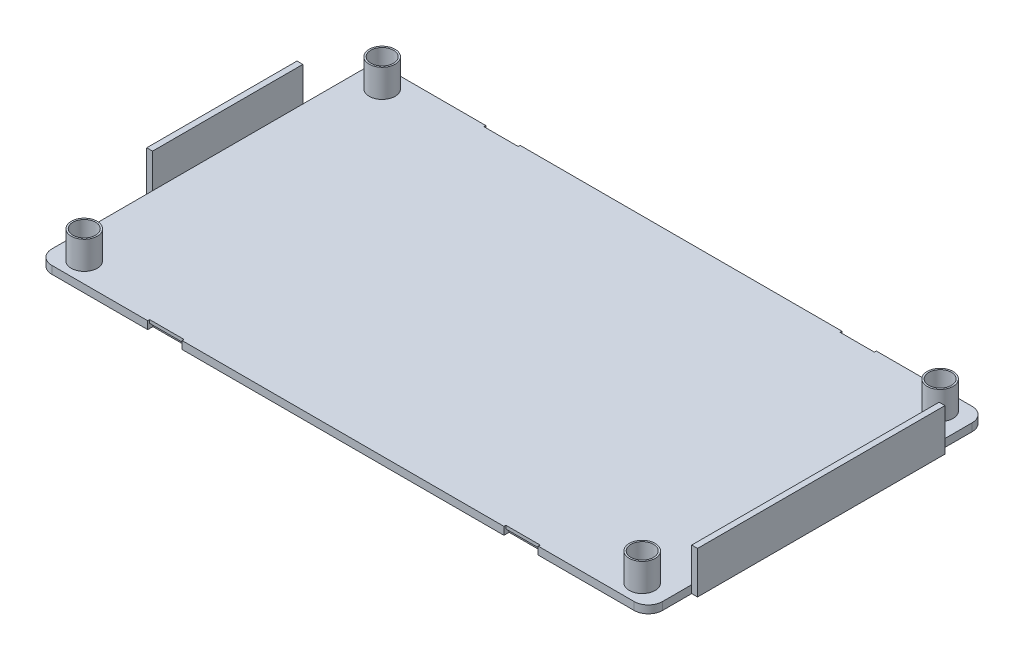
ISO-10303-21;
HEADER;
FILE_DESCRIPTION(('STEP AP214'),'2;1');
FILE_NAME('part.step','',(''),(''),'','','');
FILE_SCHEMA(('AUTOMOTIVE_DESIGN { 1 0 10303 214 1 1 1 1 }'));
ENDSEC;
DATA;
#1=APPLICATION_CONTEXT('core data for automotive mechanical design processes');
#2=APPLICATION_PROTOCOL_DEFINITION('international standard','automotive_design',2000,#1);
#3=PRODUCT_CONTEXT('',#1,'mechanical');
#4=PRODUCT('Part','Part','',(#3));
#5=PRODUCT_RELATED_PRODUCT_CATEGORY('part','',(#4));
#6=PRODUCT_DEFINITION_FORMATION('','',#4);
#7=PRODUCT_DEFINITION_CONTEXT('part definition',#1,'design');
#8=PRODUCT_DEFINITION('design','',#6,#7);
#9=PRODUCT_DEFINITION_SHAPE('','',#8);
#10=(LENGTH_UNIT() NAMED_UNIT(*) SI_UNIT(.MILLI.,.METRE.));
#11=(NAMED_UNIT(*) PLANE_ANGLE_UNIT() SI_UNIT($,.RADIAN.));
#12=(NAMED_UNIT(*) SI_UNIT($,.STERADIAN.) SOLID_ANGLE_UNIT());
#13=UNCERTAINTY_MEASURE_WITH_UNIT(LENGTH_MEASURE(1.E-05),#10,'distance_accuracy_value','');
#14=(GEOMETRIC_REPRESENTATION_CONTEXT(3) GLOBAL_UNCERTAINTY_ASSIGNED_CONTEXT((#13)) GLOBAL_UNIT_ASSIGNED_CONTEXT((#10,
#11,#12)) REPRESENTATION_CONTEXT('',''));
#15=CARTESIAN_POINT('',(0.,0.,0.));
#16=DIRECTION('',(0.,0.,1.));
#17=DIRECTION('',(1.,0.,0.));
#18=AXIS2_PLACEMENT_3D('',#15,#16,#17);
#19=CARTESIAN_POINT('',(43.0776127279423,5.5,24.559009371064));
#20=DIRECTION('',(0.,-1.,0.));
#21=DIRECTION('',(0.,0.,-1.));
#22=AXIS2_PLACEMENT_3D('',#19,#20,#21);
#23=CYLINDRICAL_SURFACE('',#22,1.75000000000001);
#24=CARTESIAN_POINT('',(43.0776127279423,1.2,24.559009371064));
#25=DIRECTION('',(0.,1.,0.));
#26=DIRECTION('',(0.,0.,-1.));
#27=AXIS2_PLACEMENT_3D('',#24,#25,#26);
#28=CIRCLE('',#27,1.75000000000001);
#29=CARTESIAN_POINT('',(43.0499999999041,1.2,22.8092272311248));
#30=VERTEX_POINT('',#29);
#31=CARTESIAN_POINT('',(43.0499999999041,1.2,26.3087915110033));
#32=VERTEX_POINT('',#31);
#33=EDGE_CURVE('E804',#30,#32,#28,.T.);
#34=ORIENTED_EDGE('',*,*,#33,.F.);
#35=CARTESIAN_POINT('',(43.0776127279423,1.2,24.559009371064));
#36=DIRECTION('',(0.,1.,0.));
#37=DIRECTION('',(0.,0.,-1.));
#38=AXIS2_PLACEMENT_3D('',#35,#36,#37);
#39=CIRCLE('',#38,1.75000000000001);
#40=EDGE_CURVE('E632',#32,#30,#39,.T.);
#41=ORIENTED_EDGE('',*,*,#40,.F.);
#42=EDGE_LOOP('',(#34,#41));
#43=FACE_BOUND('',#42,.T.);
#44=CARTESIAN_POINT('',(43.0776127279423,5.5,24.559009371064));
#45=DIRECTION('',(0.,1.,0.));
#46=DIRECTION('',(0.,0.,-1.));
#47=AXIS2_PLACEMENT_3D('',#44,#45,#46);
#48=CIRCLE('',#47,1.75000000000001);
#49=CARTESIAN_POINT('',(43.0776127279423,5.5,22.809009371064));
#50=VERTEX_POINT('',#49);
#51=EDGE_CURVE('E11',#50,#50,#48,.T.);
#52=ORIENTED_EDGE('',*,*,#51,.T.);
#53=EDGE_LOOP('',(#52));
#54=FACE_BOUND('',#53,.T.);
#55=ADVANCED_FACE('F17',(#43,#54),#23,.F.);
#56=CARTESIAN_POINT('',(43.0776127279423,5.5,24.559009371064));
#57=DIRECTION('',(0.,-1.,0.));
#58=DIRECTION('',(0.,0.,-1.));
#59=AXIS2_PLACEMENT_3D('',#56,#57,#58);
#60=CYLINDRICAL_SURFACE('',#59,2.);
#61=CARTESIAN_POINT('',(43.0776127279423,1.2,24.559009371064));
#62=DIRECTION('',(0.,1.,0.));
#63=DIRECTION('',(0.,0.,-1.));
#64=AXIS2_PLACEMENT_3D('',#61,#62,#63);
#65=CIRCLE('',#64,2.);
#66=CARTESIAN_POINT('',(43.0776127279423,1.2,22.559009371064));
#67=VERTEX_POINT('',#66);
#68=EDGE_CURVE('E27',#67,#67,#65,.T.);
#69=ORIENTED_EDGE('',*,*,#68,.T.);
#70=EDGE_LOOP('',(#69));
#71=FACE_BOUND('',#70,.T.);
#72=CARTESIAN_POINT('',(43.0776127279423,5.5,24.559009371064));
#73=DIRECTION('',(0.,1.,0.));
#74=DIRECTION('',(0.,0.,-1.));
#75=AXIS2_PLACEMENT_3D('',#72,#73,#74);
#76=CIRCLE('',#75,2.);
#77=CARTESIAN_POINT('',(43.0776127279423,5.5,22.559009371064));
#78=VERTEX_POINT('',#77);
#79=EDGE_CURVE('E800',#78,#78,#76,.T.);
#80=ORIENTED_EDGE('',*,*,#79,.F.);
#81=EDGE_LOOP('',(#80));
#82=FACE_BOUND('',#81,.T.);
#83=ADVANCED_FACE('F836',(#71,#82),#60,.T.);
#84=CARTESIAN_POINT('',(-43.0776127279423,5.5,24.559009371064));
#85=DIRECTION('',(0.,-1.,0.));
#86=DIRECTION('',(0.,0.,-1.));
#87=AXIS2_PLACEMENT_3D('',#84,#85,#86);
#88=CYLINDRICAL_SURFACE('',#87,2.);
#89=CARTESIAN_POINT('',(-43.0776127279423,1.2,24.559009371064));
#90=DIRECTION('',(0.,1.,0.));
#91=DIRECTION('',(0.,0.,1.));
#92=AXIS2_PLACEMENT_3D('',#89,#90,#91);
#93=CIRCLE('',#92,2.);
#94=CARTESIAN_POINT('',(-43.0776127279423,1.2,26.559009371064));
#95=VERTEX_POINT('',#94);
#96=EDGE_CURVE('E784',#95,#95,#93,.T.);
#97=ORIENTED_EDGE('',*,*,#96,.T.);
#98=EDGE_LOOP('',(#97));
#99=FACE_BOUND('',#98,.T.);
#100=CARTESIAN_POINT('',(-43.0776127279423,5.5,24.559009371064));
#101=DIRECTION('',(0.,1.,0.));
#102=DIRECTION('',(0.,0.,1.));
#103=AXIS2_PLACEMENT_3D('',#100,#101,#102);
#104=CIRCLE('',#103,2.);
#105=CARTESIAN_POINT('',(-43.0776127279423,5.5,26.559009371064));
#106=VERTEX_POINT('',#105);
#107=EDGE_CURVE('E795',#106,#106,#104,.T.);
#108=ORIENTED_EDGE('',*,*,#107,.F.);
#109=EDGE_LOOP('',(#108));
#110=FACE_BOUND('',#109,.T.);
#111=ADVANCED_FACE('F841',(#99,#110),#88,.T.);
#112=CARTESIAN_POINT('',(43.0776127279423,5.5,-21.440990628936));
#113=DIRECTION('',(0.,-1.,0.));
#114=DIRECTION('',(0.,0.,-1.));
#115=AXIS2_PLACEMENT_3D('',#112,#113,#114);
#116=CYLINDRICAL_SURFACE('',#115,1.75000000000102);
#117=CARTESIAN_POINT('',(43.0776127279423,1.2,-21.440990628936));
#118=DIRECTION('',(0.,1.,0.));
#119=DIRECTION('',(0.,0.,-1.));
#120=AXIS2_PLACEMENT_3D('',#117,#118,#119);
#121=CIRCLE('',#120,1.75000000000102);
#122=CARTESIAN_POINT('',(43.05,1.2,-23.1907727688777));
#123=VERTEX_POINT('',#122);
#124=CARTESIAN_POINT('',(43.05,1.2,-19.6912084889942));
#125=VERTEX_POINT('',#124);
#126=EDGE_CURVE('E771',#123,#125,#121,.T.);
#127=ORIENTED_EDGE('',*,*,#126,.F.);
#128=CARTESIAN_POINT('',(43.0776127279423,1.2,-21.440990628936));
#129=DIRECTION('',(0.,1.,0.));
#130=DIRECTION('',(0.,0.,-1.));
#131=AXIS2_PLACEMENT_3D('',#128,#129,#130);
#132=CIRCLE('',#131,1.75000000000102);
#133=EDGE_CURVE('E639',#125,#123,#132,.T.);
#134=ORIENTED_EDGE('',*,*,#133,.F.);
#135=EDGE_LOOP('',(#127,#134));
#136=FACE_BOUND('',#135,.T.);
#137=CARTESIAN_POINT('',(43.0776127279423,5.5,-21.440990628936));
#138=DIRECTION('',(0.,1.,0.));
#139=DIRECTION('',(0.,0.,-1.));
#140=AXIS2_PLACEMENT_3D('',#137,#138,#139);
#141=CIRCLE('',#140,1.75000000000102);
#142=CARTESIAN_POINT('',(43.0776127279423,5.5,-23.190990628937));
#143=VERTEX_POINT('',#142);
#144=EDGE_CURVE('E780',#143,#143,#141,.T.);
#145=ORIENTED_EDGE('',*,*,#144,.T.);
#146=EDGE_LOOP('',(#145));
#147=FACE_BOUND('',#146,.T.);
#148=ADVANCED_FACE('F847',(#136,#147),#116,.F.);
#149=CARTESIAN_POINT('',(43.0776127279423,5.5,-21.440990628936));
#150=DIRECTION('',(0.,-1.,0.));
#151=DIRECTION('',(0.,0.,-1.));
#152=AXIS2_PLACEMENT_3D('',#149,#150,#151);
#153=CYLINDRICAL_SURFACE('',#152,2.);
#154=CARTESIAN_POINT('',(43.0776127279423,1.2,-21.440990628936));
#155=DIRECTION('',(0.,1.,0.));
#156=DIRECTION('',(0.,0.,-1.));
#157=AXIS2_PLACEMENT_3D('',#154,#155,#156);
#158=CIRCLE('',#157,2.);
#159=CARTESIAN_POINT('',(43.0776127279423,1.2,-23.440990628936));
#160=VERTEX_POINT('',#159);
#161=EDGE_CURVE('E774',#160,#160,#158,.T.);
#162=ORIENTED_EDGE('',*,*,#161,.T.);
#163=EDGE_LOOP('',(#162));
#164=FACE_BOUND('',#163,.T.);
#165=CARTESIAN_POINT('',(43.0776127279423,5.5,-21.440990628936));
#166=DIRECTION('',(0.,1.,0.));
#167=DIRECTION('',(0.,0.,-1.));
#168=AXIS2_PLACEMENT_3D('',#165,#166,#167);
#169=CIRCLE('',#168,2.);
#170=CARTESIAN_POINT('',(43.0776127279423,5.5,-23.440990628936));
#171=VERTEX_POINT('',#170);
#172=EDGE_CURVE('E766',#171,#171,#169,.T.);
#173=ORIENTED_EDGE('',*,*,#172,.F.);
#174=EDGE_LOOP('',(#173));
#175=FACE_BOUND('',#174,.T.);
#176=ADVANCED_FACE('F833',(#164,#175),#153,.T.);
#177=CARTESIAN_POINT('',(-43.0776127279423,5.5,-21.440990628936));
#178=DIRECTION('',(0.,-1.,0.));
#179=DIRECTION('',(0.,0.,-1.));
#180=AXIS2_PLACEMENT_3D('',#177,#178,#179);
#181=CYLINDRICAL_SURFACE('',#180,2.);
#182=CARTESIAN_POINT('',(-43.0776127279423,1.2,-21.440990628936));
#183=DIRECTION('',(0.,1.,0.));
#184=DIRECTION('',(0.,0.,1.));
#185=AXIS2_PLACEMENT_3D('',#182,#183,#184);
#186=CIRCLE('',#185,2.);
#187=CARTESIAN_POINT('',(-43.0776127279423,1.2,-19.440990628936));
#188=VERTEX_POINT('',#187);
#189=EDGE_CURVE('E775',#188,#188,#186,.T.);
#190=ORIENTED_EDGE('',*,*,#189,.T.);
#191=EDGE_LOOP('',(#190));
#192=FACE_BOUND('',#191,.T.);
#193=CARTESIAN_POINT('',(-43.0776127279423,5.5,-21.440990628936));
#194=DIRECTION('',(0.,1.,0.));
#195=DIRECTION('',(0.,0.,1.));
#196=AXIS2_PLACEMENT_3D('',#193,#194,#195);
#197=CIRCLE('',#196,2.);
#198=CARTESIAN_POINT('',(-43.0776127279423,5.5,-19.440990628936));
#199=VERTEX_POINT('',#198);
#200=EDGE_CURVE('E764',#199,#199,#197,.T.);
#201=ORIENTED_EDGE('',*,*,#200,.F.);
#202=EDGE_LOOP('',(#201));
#203=FACE_BOUND('',#202,.T.);
#204=ADVANCED_FACE('F822',(#192,#203),#181,.T.);
#205=CARTESIAN_POINT('',(43.0223872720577,1.2,24.559009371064));
#206=DIRECTION('',(0.,-1.,0.));
#207=DIRECTION('',(0.,0.,-1.));
#208=AXIS2_PLACEMENT_3D('',#205,#206,#207);
#209=CYLINDRICAL_SURFACE('',#208,1.74999999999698);
#210=CARTESIAN_POINT('',(43.0223872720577,0.,24.559009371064));
#211=DIRECTION('',(0.,1.,0.));
#212=DIRECTION('',(0.,0.,1.));
#213=AXIS2_PLACEMENT_3D('',#210,#211,#212);
#214=CIRCLE('',#213,1.74999999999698);
#215=CARTESIAN_POINT('',(43.0223872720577,0.,26.309009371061));
#216=VERTEX_POINT('',#215);
#217=EDGE_CURVE('E694',#216,#216,#214,.T.);
#218=ORIENTED_EDGE('',*,*,#217,.F.);
#219=EDGE_LOOP('',(#218));
#220=FACE_BOUND('',#219,.T.);
#221=CARTESIAN_POINT('',(43.0223872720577,1.2,24.559009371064));
#222=DIRECTION('',(0.,1.,0.));
#223=DIRECTION('',(0.,0.,1.));
#224=AXIS2_PLACEMENT_3D('',#221,#222,#223);
#225=CIRCLE('',#224,1.74999999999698);
#226=EDGE_CURVE('E35',#30,#32,#225,.T.);
#227=ORIENTED_EDGE('',*,*,#226,.T.);
#228=CARTESIAN_POINT('',(43.0223872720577,1.2,24.559009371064));
#229=DIRECTION('',(0.,1.,0.));
#230=DIRECTION('',(0.,0.,1.));
#231=AXIS2_PLACEMENT_3D('',#228,#229,#230);
#232=CIRCLE('',#231,1.74999999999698);
#233=EDGE_CURVE('E440',#32,#30,#232,.T.);
#234=ORIENTED_EDGE('',*,*,#233,.T.);
#235=EDGE_LOOP('',(#227,#234));
#236=FACE_BOUND('',#235,.T.);
#237=ADVANCED_FACE('F819',(#220,#236),#209,.F.);
#238=CARTESIAN_POINT('',(-43.0776127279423,1.2,24.559009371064));
#239=DIRECTION('',(0.,-1.,0.));
#240=DIRECTION('',(0.,0.,-1.));
#241=AXIS2_PLACEMENT_3D('',#238,#239,#240);
#242=CYLINDRICAL_SURFACE('',#241,1.75000000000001);
#243=CARTESIAN_POINT('',(-43.0776127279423,0.,24.559009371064));
#244=DIRECTION('',(0.,1.,0.));
#245=DIRECTION('',(0.,0.,1.));
#246=AXIS2_PLACEMENT_3D('',#243,#244,#245);
#247=CIRCLE('',#246,1.75000000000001);
#248=CARTESIAN_POINT('',(-43.0776127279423,0.,26.309009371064));
#249=VERTEX_POINT('',#248);
#250=EDGE_CURVE('E646',#249,#249,#247,.T.);
#251=ORIENTED_EDGE('',*,*,#250,.F.);
#252=EDGE_LOOP('',(#251));
#253=FACE_BOUND('',#252,.T.);
#254=CARTESIAN_POINT('',(-43.0776127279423,5.5,24.559009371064));
#255=DIRECTION('',(0.,1.,0.));
#256=DIRECTION('',(0.,0.,1.));
#257=AXIS2_PLACEMENT_3D('',#254,#255,#256);
#258=CIRCLE('',#257,1.75000000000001);
#259=CARTESIAN_POINT('',(-43.0776127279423,5.5,26.309009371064));
#260=VERTEX_POINT('',#259);
#261=EDGE_CURVE('E709',#260,#260,#258,.T.);
#262=ORIENTED_EDGE('',*,*,#261,.T.);
#263=EDGE_LOOP('',(#262));
#264=FACE_BOUND('',#263,.T.);
#265=ADVANCED_FACE('F821',(#253,#264),#242,.F.);
#266=CARTESIAN_POINT('',(43.0223872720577,1.2,-21.440990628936));
#267=DIRECTION('',(0.,-1.,0.));
#268=DIRECTION('',(0.,0.,-1.));
#269=AXIS2_PLACEMENT_3D('',#266,#267,#268);
#270=CYLINDRICAL_SURFACE('',#269,1.75000000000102);
#271=CARTESIAN_POINT('',(43.0223872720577,0.,-21.440990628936));
#272=DIRECTION('',(0.,1.,0.));
#273=DIRECTION('',(0.,0.,1.));
#274=AXIS2_PLACEMENT_3D('',#271,#272,#273);
#275=CIRCLE('',#274,1.75000000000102);
#276=CARTESIAN_POINT('',(43.0223872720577,0.,-19.690990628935));
#277=VERTEX_POINT('',#276);
#278=EDGE_CURVE('E699',#277,#277,#275,.T.);
#279=ORIENTED_EDGE('',*,*,#278,.F.);
#280=EDGE_LOOP('',(#279));
#281=FACE_BOUND('',#280,.T.);
#282=CARTESIAN_POINT('',(43.0223872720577,1.2,-21.440990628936));
#283=DIRECTION('',(0.,1.,0.));
#284=DIRECTION('',(0.,0.,1.));
#285=AXIS2_PLACEMENT_3D('',#282,#283,#284);
#286=CIRCLE('',#285,1.75000000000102);
#287=EDGE_CURVE('E712',#123,#125,#286,.T.);
#288=ORIENTED_EDGE('',*,*,#287,.T.);
#289=CARTESIAN_POINT('',(43.0223872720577,1.2,-21.440990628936));
#290=DIRECTION('',(0.,1.,0.));
#291=DIRECTION('',(0.,0.,1.));
#292=AXIS2_PLACEMENT_3D('',#289,#290,#291);
#293=CIRCLE('',#292,1.75000000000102);
#294=EDGE_CURVE('E331',#125,#123,#293,.T.);
#295=ORIENTED_EDGE('',*,*,#294,.T.);
#296=EDGE_LOOP('',(#288,#295));
#297=FACE_BOUND('',#296,.T.);
#298=ADVANCED_FACE('F830',(#281,#297),#270,.F.);
#299=CARTESIAN_POINT('',(-43.0776127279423,1.2,-21.440990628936));
#300=DIRECTION('',(0.,-1.,0.));
#301=DIRECTION('',(0.,0.,-1.));
#302=AXIS2_PLACEMENT_3D('',#299,#300,#301);
#303=CYLINDRICAL_SURFACE('',#302,1.75000000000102);
#304=CARTESIAN_POINT('',(-43.0776127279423,0.,-21.440990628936));
#305=DIRECTION('',(0.,1.,0.));
#306=DIRECTION('',(0.,0.,1.));
#307=AXIS2_PLACEMENT_3D('',#304,#305,#306);
#308=CIRCLE('',#307,1.75000000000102);
#309=CARTESIAN_POINT('',(-43.0776127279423,0.,-19.690990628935));
#310=VERTEX_POINT('',#309);
#311=EDGE_CURVE('E704',#310,#310,#308,.T.);
#312=ORIENTED_EDGE('',*,*,#311,.F.);
#313=EDGE_LOOP('',(#312));
#314=FACE_BOUND('',#313,.T.);
#315=CARTESIAN_POINT('',(-43.0776127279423,5.5,-21.440990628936));
#316=DIRECTION('',(0.,1.,0.));
#317=DIRECTION('',(0.,0.,1.));
#318=AXIS2_PLACEMENT_3D('',#315,#316,#317);
#319=CIRCLE('',#318,1.75000000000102);
#320=CARTESIAN_POINT('',(-43.0776127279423,5.5,-19.690990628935));
#321=VERTEX_POINT('',#320);
#322=EDGE_CURVE('E715',#321,#321,#319,.T.);
#323=ORIENTED_EDGE('',*,*,#322,.T.);
#324=EDGE_LOOP('',(#323));
#325=FACE_BOUND('',#324,.T.);
#326=ADVANCED_FACE('F1365',(#314,#325),#303,.F.);
#327=CARTESIAN_POINT('',(44.9223872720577,1.2,25.459009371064));
#328=DIRECTION('',(0.,1.,0.));
#329=DIRECTION('',(0.,0.,1.));
#330=AXIS2_PLACEMENT_3D('',#327,#328,#329);
#331=PLANE('',#330);
#332=ORIENTED_EDGE('',*,*,#161,.F.);
#333=EDGE_LOOP('',(#332));
#334=FACE_BOUND('',#333,.T.);
#335=ORIENTED_EDGE('',*,*,#189,.F.);
#336=EDGE_LOOP('',(#335));
#337=FACE_BOUND('',#336,.T.);
#338=DIRECTION('',(0.,0.,-1.));
#339=VECTOR('',#338,1.);
#340=CARTESIAN_POINT('',(47.1223872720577,1.2,20.959009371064));
#341=LINE('',#340,#339);
#342=CARTESIAN_POINT('',(47.1223872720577,1.2,25.459009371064));
#343=VERTEX_POINT('',#342);
#344=CARTESIAN_POINT('',(47.1223872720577,1.2,20.959009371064));
#345=VERTEX_POINT('',#344);
#346=EDGE_CURVE('E719',#343,#345,#341,.T.);
#347=ORIENTED_EDGE('',*,*,#346,.T.);
#348=DIRECTION('',(0.,0.,-1.));
#349=VECTOR('',#348,1.);
#350=CARTESIAN_POINT('',(47.1223872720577,1.2,25.459009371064));
#351=LINE('',#350,#349);
#352=CARTESIAN_POINT('',(47.1223872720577,1.2,-17.240990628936));
#353=VERTEX_POINT('',#352);
#354=EDGE_CURVE('E723',#345,#353,#351,.T.);
#355=ORIENTED_EDGE('',*,*,#354,.T.);
#356=DIRECTION('',(0.,0.,-1.));
#357=VECTOR('',#356,1.);
#358=CARTESIAN_POINT('',(47.1223872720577,1.2,-22.340990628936));
#359=LINE('',#358,#357);
#360=CARTESIAN_POINT('',(47.1223872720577,1.2,-22.340990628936));
#361=VERTEX_POINT('',#360);
#362=EDGE_CURVE('E726',#353,#361,#359,.T.);
#363=ORIENTED_EDGE('',*,*,#362,.T.);
#364=CARTESIAN_POINT('',(44.9223872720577,1.2,-22.340990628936));
#365=DIRECTION('',(0.,1.,0.));
#366=DIRECTION('',(0.,0.,1.));
#367=AXIS2_PLACEMENT_3D('',#364,#365,#366);
#368=CIRCLE('',#367,2.2);
#369=CARTESIAN_POINT('',(44.9223872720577,1.2,-24.540990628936));
#370=VERTEX_POINT('',#369);
#371=EDGE_CURVE('E729',#361,#370,#368,.T.);
#372=ORIENTED_EDGE('',*,*,#371,.T.);
#373=DIRECTION('',(-1.,0.,0.));
#374=VECTOR('',#373,1.);
#375=CARTESIAN_POINT('',(30.1223872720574,1.2,-24.540990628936));
#376=LINE('',#375,#374);
#377=CARTESIAN_POINT('',(30.1223872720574,1.2,-24.540990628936));
#378=VERTEX_POINT('',#377);
#379=EDGE_CURVE('E554',#370,#378,#376,.T.);
#380=ORIENTED_EDGE('',*,*,#379,.T.);
#381=DIRECTION('',(1.01770443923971E-12,0.,1.));
#382=VECTOR('',#381,1.);
#383=CARTESIAN_POINT('',(30.1223872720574,1.2,-24.540990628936));
#384=LINE('',#383,#382);
#385=CARTESIAN_POINT('',(30.1223872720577,1.2,-24.240990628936));
#386=VERTEX_POINT('',#385);
#387=EDGE_CURVE('E547',#378,#386,#384,.T.);
#388=ORIENTED_EDGE('',*,*,#387,.T.);
#389=DIRECTION('',(-1.,0.,0.));
#390=VECTOR('',#389,1.);
#391=CARTESIAN_POINT('',(24.8223872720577,1.2,-24.240990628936));
#392=LINE('',#391,#390);
#393=CARTESIAN_POINT('',(24.8223872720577,1.2,-24.240990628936));
#394=VERTEX_POINT('',#393);
#395=EDGE_CURVE('E543',#386,#394,#392,.T.);
#396=ORIENTED_EDGE('',*,*,#395,.T.);
#397=DIRECTION('',(0.,0.,-1.));
#398=VECTOR('',#397,1.);
#399=CARTESIAN_POINT('',(24.8223872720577,1.2,-24.540990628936));
#400=LINE('',#399,#398);
#401=CARTESIAN_POINT('',(24.8223872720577,1.2,-24.540990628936));
#402=VERTEX_POINT('',#401);
#403=EDGE_CURVE('E540',#394,#402,#400,.T.);
#404=ORIENTED_EDGE('',*,*,#403,.T.);
#405=DIRECTION('',(-1.,0.,0.));
#406=VECTOR('',#405,1.);
#407=CARTESIAN_POINT('',(24.8223872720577,1.2,-24.540990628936));
#408=LINE('',#407,#406);
#409=CARTESIAN_POINT('',(-24.8776127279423,1.2,-24.540990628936));
#410=VERTEX_POINT('',#409);
#411=EDGE_CURVE('E572',#402,#410,#408,.T.);
#412=ORIENTED_EDGE('',*,*,#411,.T.);
#413=DIRECTION('',(0.,0.,1.));
#414=VECTOR('',#413,1.);
#415=CARTESIAN_POINT('',(-24.8776127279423,1.2,-24.540990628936));
#416=LINE('',#415,#414);
#417=CARTESIAN_POINT('',(-24.8776127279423,1.2,-24.240990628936));
#418=VERTEX_POINT('',#417);
#419=EDGE_CURVE('E574',#410,#418,#416,.T.);
#420=ORIENTED_EDGE('',*,*,#419,.T.);
#421=DIRECTION('',(-1.,0.,0.));
#422=VECTOR('',#421,1.);
#423=CARTESIAN_POINT('',(-24.8776127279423,1.2,-24.240990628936));
#424=LINE('',#423,#422);
#425=CARTESIAN_POINT('',(-30.1776127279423,1.2,-24.240990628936));
#426=VERTEX_POINT('',#425);
#427=EDGE_CURVE('E579',#418,#426,#424,.T.);
#428=ORIENTED_EDGE('',*,*,#427,.T.);
#429=DIRECTION('',(0.,0.,-1.));
#430=VECTOR('',#429,1.);
#431=CARTESIAN_POINT('',(-30.1776127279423,1.2,-24.540990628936));
#432=LINE('',#431,#430);
#433=CARTESIAN_POINT('',(-30.1776127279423,1.2,-24.540990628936));
#434=VERTEX_POINT('',#433);
#435=EDGE_CURVE('E582',#426,#434,#432,.T.);
#436=ORIENTED_EDGE('',*,*,#435,.T.);
#437=DIRECTION('',(-1.,0.,0.));
#438=VECTOR('',#437,1.);
#439=CARTESIAN_POINT('',(-30.1776127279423,1.2,-24.540990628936));
#440=LINE('',#439,#438);
#441=CARTESIAN_POINT('',(-44.9776127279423,1.2,-24.540990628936));
#442=VERTEX_POINT('',#441);
#443=EDGE_CURVE('E585',#434,#442,#440,.T.);
#444=ORIENTED_EDGE('',*,*,#443,.T.);
#445=CARTESIAN_POINT('',(-44.9776127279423,1.2,-22.340990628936));
#446=DIRECTION('',(0.,1.,0.));
#447=DIRECTION('',(0.,0.,1.));
#448=AXIS2_PLACEMENT_3D('',#445,#446,#447);
#449=CIRCLE('',#448,2.20000000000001);
#450=CARTESIAN_POINT('',(-47.1776127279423,1.2,-22.340990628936));
#451=VERTEX_POINT('',#450);
#452=EDGE_CURVE('E588',#442,#451,#449,.T.);
#453=ORIENTED_EDGE('',*,*,#452,.T.);
#454=DIRECTION('',(0.,0.,1.));
#455=VECTOR('',#454,1.);
#456=CARTESIAN_POINT('',(-47.1776127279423,1.2,-22.340990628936));
#457=LINE('',#456,#455);
#458=CARTESIAN_POINT('',(-47.1776127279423,1.2,-13.290990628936));
#459=VERTEX_POINT('',#458);
#460=EDGE_CURVE('E591',#451,#459,#457,.T.);
#461=ORIENTED_EDGE('',*,*,#460,.T.);
#462=DIRECTION('',(0.,0.,1.));
#463=VECTOR('',#462,1.);
#464=CARTESIAN_POINT('',(-47.1776127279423,1.2,25.459009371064));
#465=LINE('',#464,#463);
#466=CARTESIAN_POINT('',(-47.1776127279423,1.2,9.909009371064));
#467=VERTEX_POINT('',#466);
#468=EDGE_CURVE('E594',#459,#467,#465,.T.);
#469=ORIENTED_EDGE('',*,*,#468,.T.);
#470=DIRECTION('',(0.,0.,1.));
#471=VECTOR('',#470,1.);
#472=CARTESIAN_POINT('',(-47.1776127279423,1.2,9.909009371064));
#473=LINE('',#472,#471);
#474=CARTESIAN_POINT('',(-47.1776127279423,1.2,25.459009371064));
#475=VERTEX_POINT('',#474);
#476=EDGE_CURVE('E597',#467,#475,#473,.T.);
#477=ORIENTED_EDGE('',*,*,#476,.T.);
#478=CARTESIAN_POINT('',(-44.9776127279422,1.2,25.459009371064));
#479=DIRECTION('',(0.,1.,0.));
#480=DIRECTION('',(0.,0.,1.));
#481=AXIS2_PLACEMENT_3D('',#478,#479,#480);
#482=CIRCLE('',#481,2.20000000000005);
#483=CARTESIAN_POINT('',(-44.9776127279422,1.2,27.659009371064));
#484=VERTEX_POINT('',#483);
#485=EDGE_CURVE('E600',#475,#484,#482,.T.);
#486=ORIENTED_EDGE('',*,*,#485,.T.);
#487=DIRECTION('',(1.,0.,0.));
#488=VECTOR('',#487,1.);
#489=CARTESIAN_POINT('',(-30.1776127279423,1.2,27.659009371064));
#490=LINE('',#489,#488);
#491=CARTESIAN_POINT('',(-30.1776127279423,1.2,27.659009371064));
#492=VERTEX_POINT('',#491);
#493=EDGE_CURVE('E603',#484,#492,#490,.T.);
#494=ORIENTED_EDGE('',*,*,#493,.T.);
#495=DIRECTION('',(0.,0.,-1.));
#496=VECTOR('',#495,1.);
#497=CARTESIAN_POINT('',(-30.1776127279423,1.2,27.659009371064));
#498=LINE('',#497,#496);
#499=CARTESIAN_POINT('',(-30.1776127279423,1.2,27.359009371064));
#500=VERTEX_POINT('',#499);
#501=EDGE_CURVE('E606',#492,#500,#498,.T.);
#502=ORIENTED_EDGE('',*,*,#501,.T.);
#503=DIRECTION('',(1.,0.,0.));
#504=VECTOR('',#503,1.);
#505=CARTESIAN_POINT('',(-24.8776127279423,1.2,27.359009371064));
#506=LINE('',#505,#504);
#507=CARTESIAN_POINT('',(-24.8776127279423,1.2,27.359009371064));
#508=VERTEX_POINT('',#507);
#509=EDGE_CURVE('E609',#500,#508,#506,.T.);
#510=ORIENTED_EDGE('',*,*,#509,.T.);
#511=DIRECTION('',(0.,0.,1.));
#512=VECTOR('',#511,1.);
#513=CARTESIAN_POINT('',(-24.8776127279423,1.2,27.659009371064));
#514=LINE('',#513,#512);
#515=CARTESIAN_POINT('',(-24.8776127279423,1.2,27.659009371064));
#516=VERTEX_POINT('',#515);
#517=EDGE_CURVE('E612',#508,#516,#514,.T.);
#518=ORIENTED_EDGE('',*,*,#517,.T.);
#519=DIRECTION('',(1.,0.,0.));
#520=VECTOR('',#519,1.);
#521=CARTESIAN_POINT('',(24.8223872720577,1.2,27.659009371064));
#522=LINE('',#521,#520);
#523=CARTESIAN_POINT('',(24.8223872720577,1.2,27.659009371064));
#524=VERTEX_POINT('',#523);
#525=EDGE_CURVE('E615',#516,#524,#522,.T.);
#526=ORIENTED_EDGE('',*,*,#525,.T.);
#527=DIRECTION('',(0.,0.,-1.));
#528=VECTOR('',#527,1.);
#529=CARTESIAN_POINT('',(24.8223872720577,1.2,27.659009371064));
#530=LINE('',#529,#528);
#531=CARTESIAN_POINT('',(24.8223872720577,1.2,27.359009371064));
#532=VERTEX_POINT('',#531);
#533=EDGE_CURVE('E618',#524,#532,#530,.T.);
#534=ORIENTED_EDGE('',*,*,#533,.T.);
#535=DIRECTION('',(1.,0.,0.));
#536=VECTOR('',#535,1.);
#537=CARTESIAN_POINT('',(24.8223872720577,1.2,27.359009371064));
#538=LINE('',#537,#536);
#539=CARTESIAN_POINT('',(30.1223872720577,1.2,27.359009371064));
#540=VERTEX_POINT('',#539);
#541=EDGE_CURVE('E621',#532,#540,#538,.T.);
#542=ORIENTED_EDGE('',*,*,#541,.T.);
#543=DIRECTION('',(0.,0.,1.));
#544=VECTOR('',#543,1.);
#545=CARTESIAN_POINT('',(30.1223872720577,1.2,27.659009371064));
#546=LINE('',#545,#544);
#547=CARTESIAN_POINT('',(30.1223872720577,1.2,27.659009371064));
#548=VERTEX_POINT('',#547);
#549=EDGE_CURVE('E624',#540,#548,#546,.T.);
#550=ORIENTED_EDGE('',*,*,#549,.T.);
#551=DIRECTION('',(1.,0.,0.));
#552=VECTOR('',#551,1.);
#553=CARTESIAN_POINT('',(30.1223872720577,1.2,27.659009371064));
#554=LINE('',#553,#552);
#555=CARTESIAN_POINT('',(44.9223872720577,1.2,27.659009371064));
#556=VERTEX_POINT('',#555);
#557=EDGE_CURVE('E627',#548,#556,#554,.T.);
#558=ORIENTED_EDGE('',*,*,#557,.T.);
#559=CARTESIAN_POINT('',(44.9223872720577,1.2,25.459009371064));
#560=DIRECTION('',(0.,1.,0.));
#561=DIRECTION('',(0.,0.,1.));
#562=AXIS2_PLACEMENT_3D('',#559,#560,#561);
#563=CIRCLE('',#562,2.20000000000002);
#564=EDGE_CURVE('E630',#556,#343,#563,.T.);
#565=ORIENTED_EDGE('',*,*,#564,.T.);
#566=EDGE_LOOP('',(#347,#355,#363,#372,#380,#388,#396,#404,#412,#420,#428,#436,#444,#453,#461,
#469,#477,#486,#494,#502,#510,#518,#526,#534,#542,#550,#558,#565));
#567=FACE_BOUND('',#566,.T.);
#568=ORIENTED_EDGE('',*,*,#96,.F.);
#569=EDGE_LOOP('',(#568));
#570=FACE_BOUND('',#569,.T.);
#571=ORIENTED_EDGE('',*,*,#68,.F.);
#572=EDGE_LOOP('',(#571));
#573=FACE_BOUND('',#572,.T.);
#574=ADVANCED_FACE('F551',(#334,#337,#567,#570,#573),#331,.T.);
#575=CARTESIAN_POINT('',(44.9223872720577,1.2,25.459009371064));
#576=DIRECTION('',(0.,1.,0.));
#577=DIRECTION('',(0.,0.,1.));
#578=AXIS2_PLACEMENT_3D('',#575,#576,#577);
#579=PLANE('',#578);
#580=ORIENTED_EDGE('',*,*,#40,.T.);
#581=ORIENTED_EDGE('',*,*,#233,.F.);
#582=EDGE_LOOP('',(#580,#581));
#583=FACE_BOUND('',#582,.T.);
#584=ADVANCED_FACE('F815',(#583),#579,.T.);
#585=CARTESIAN_POINT('',(44.9223872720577,1.2,25.459009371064));
#586=DIRECTION('',(0.,1.,0.));
#587=DIRECTION('',(0.,0.,1.));
#588=AXIS2_PLACEMENT_3D('',#585,#586,#587);
#589=PLANE('',#588);
#590=ORIENTED_EDGE('',*,*,#133,.T.);
#591=ORIENTED_EDGE('',*,*,#294,.F.);
#592=EDGE_LOOP('',(#590,#591));
#593=FACE_BOUND('',#592,.T.);
#594=ADVANCED_FACE('F1337',(#593),#589,.T.);
#595=CARTESIAN_POINT('',(24.8223872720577,1.2,27.359009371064));
#596=DIRECTION('',(0.,0.,-1.));
#597=DIRECTION('',(-1.,0.,0.));
#598=AXIS2_PLACEMENT_3D('',#595,#596,#597);
#599=PLANE('',#598);
#600=DIRECTION('',(-1.,0.,0.));
#601=VECTOR('',#600,1.);
#602=CARTESIAN_POINT('',(24.8223872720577,0.7,27.359009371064));
#603=LINE('',#602,#601);
#604=CARTESIAN_POINT('',(30.1223872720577,0.7,27.359009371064));
#605=VERTEX_POINT('',#604);
#606=CARTESIAN_POINT('',(24.8223872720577,0.7,27.359009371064));
#607=VERTEX_POINT('',#606);
#608=EDGE_CURVE('E322',#605,#607,#603,.T.);
#609=ORIENTED_EDGE('',*,*,#608,.F.);
#610=DIRECTION('',(0.,-1.,0.));
#611=VECTOR('',#610,1.);
#612=CARTESIAN_POINT('',(30.1223872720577,1.2,27.359009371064));
#613=LINE('',#612,#611);
#614=EDGE_CURVE('E309',#540,#605,#613,.T.);
#615=ORIENTED_EDGE('',*,*,#614,.F.);
#616=ORIENTED_EDGE('',*,*,#541,.F.);
#617=DIRECTION('',(0.,-1.,0.));
#618=VECTOR('',#617,1.);
#619=CARTESIAN_POINT('',(24.8223872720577,1.2,27.359009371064));
#620=LINE('',#619,#618);
#621=EDGE_CURVE('E636',#532,#607,#620,.T.);
#622=ORIENTED_EDGE('',*,*,#621,.T.);
#623=EDGE_LOOP('',(#609,#615,#616,#622));
#624=FACE_BOUND('',#623,.T.);
#625=ADVANCED_FACE('F1328',(#624),#599,.F.);
#626=CARTESIAN_POINT('',(-24.8776127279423,1.2,27.359009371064));
#627=DIRECTION('',(0.,0.,-1.));
#628=DIRECTION('',(-1.,0.,0.));
#629=AXIS2_PLACEMENT_3D('',#626,#627,#628);
#630=PLANE('',#629);
#631=DIRECTION('',(-1.,0.,0.));
#632=VECTOR('',#631,1.);
#633=CARTESIAN_POINT('',(-24.8776127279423,0.7,27.359009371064));
#634=LINE('',#633,#632);
#635=CARTESIAN_POINT('',(-24.8776127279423,0.7,27.359009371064));
#636=VERTEX_POINT('',#635);
#637=CARTESIAN_POINT('',(-30.1776127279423,0.7,27.359009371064));
#638=VERTEX_POINT('',#637);
#639=EDGE_CURVE('E459',#636,#638,#634,.T.);
#640=ORIENTED_EDGE('',*,*,#639,.F.);
#641=DIRECTION('',(0.,-1.,0.));
#642=VECTOR('',#641,1.);
#643=CARTESIAN_POINT('',(-24.8776127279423,1.2,27.359009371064));
#644=LINE('',#643,#642);
#645=EDGE_CURVE('E469',#508,#636,#644,.T.);
#646=ORIENTED_EDGE('',*,*,#645,.F.);
#647=ORIENTED_EDGE('',*,*,#509,.F.);
#648=DIRECTION('',(0.,-1.,0.));
#649=VECTOR('',#648,1.);
#650=CARTESIAN_POINT('',(-30.1776127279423,1.2,27.359009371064));
#651=LINE('',#650,#649);
#652=EDGE_CURVE('E640',#500,#638,#651,.T.);
#653=ORIENTED_EDGE('',*,*,#652,.T.);
#654=EDGE_LOOP('',(#640,#646,#647,#653));
#655=FACE_BOUND('',#654,.T.);
#656=ADVANCED_FACE('F1319',(#655),#630,.F.);
#657=CARTESIAN_POINT('',(44.9223872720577,0.,25.459009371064));
#658=DIRECTION('',(0.,1.,0.));
#659=DIRECTION('',(0.,0.,1.));
#660=AXIS2_PLACEMENT_3D('',#657,#658,#659);
#661=PLANE('',#660);
#662=DIRECTION('',(1.,0.,0.));
#663=VECTOR('',#662,1.);
#664=CARTESIAN_POINT('',(24.8223872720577,0.,26.859009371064));
#665=LINE('',#664,#663);
#666=CARTESIAN_POINT('',(24.8223872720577,0.,26.859009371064));
#667=VERTEX_POINT('',#666);
#668=CARTESIAN_POINT('',(30.1223872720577,0.,26.859009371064));
#669=VERTEX_POINT('',#668);
#670=EDGE_CURVE('E312',#667,#669,#665,.T.);
#671=ORIENTED_EDGE('',*,*,#670,.F.);
#672=DIRECTION('',(0.,0.,-1.));
#673=VECTOR('',#672,1.);
#674=CARTESIAN_POINT('',(24.8223872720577,0.,27.659009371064));
#675=LINE('',#674,#673);
#676=CARTESIAN_POINT('',(24.8223872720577,0.,27.659009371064));
#677=VERTEX_POINT('',#676);
#678=EDGE_CURVE('E464',#677,#667,#675,.T.);
#679=ORIENTED_EDGE('',*,*,#678,.F.);
#680=DIRECTION('',(1.,0.,0.));
#681=VECTOR('',#680,1.);
#682=CARTESIAN_POINT('',(24.8223872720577,0.,27.659009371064));
#683=LINE('',#682,#681);
#684=CARTESIAN_POINT('',(-24.8776127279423,0.,27.659009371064));
#685=VERTEX_POINT('',#684);
#686=EDGE_CURVE('E463',#685,#677,#683,.T.);
#687=ORIENTED_EDGE('',*,*,#686,.F.);
#688=DIRECTION('',(0.,0.,1.));
#689=VECTOR('',#688,1.);
#690=CARTESIAN_POINT('',(-24.8776127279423,0.,27.659009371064));
#691=LINE('',#690,#689);
#692=CARTESIAN_POINT('',(-24.8776127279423,0.,26.859009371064));
#693=VERTEX_POINT('',#692);
#694=EDGE_CURVE('E453',#693,#685,#691,.T.);
#695=ORIENTED_EDGE('',*,*,#694,.F.);
#696=DIRECTION('',(1.,0.,0.));
#697=VECTOR('',#696,1.);
#698=CARTESIAN_POINT('',(-30.1776127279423,0.,26.859009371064));
#699=LINE('',#698,#697);
#700=CARTESIAN_POINT('',(-30.1776127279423,0.,26.859009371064));
#701=VERTEX_POINT('',#700);
#702=EDGE_CURVE('E456',#701,#693,#699,.T.);
#703=ORIENTED_EDGE('',*,*,#702,.F.);
#704=DIRECTION('',(0.,0.,-1.));
#705=VECTOR('',#704,1.);
#706=CARTESIAN_POINT('',(-30.1776127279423,0.,27.659009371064));
#707=LINE('',#706,#705);
#708=CARTESIAN_POINT('',(-30.1776127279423,0.,27.659009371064));
#709=VERTEX_POINT('',#708);
#710=EDGE_CURVE('E449',#709,#701,#707,.T.);
#711=ORIENTED_EDGE('',*,*,#710,.F.);
#712=DIRECTION('',(1.,0.,0.));
#713=VECTOR('',#712,1.);
#714=CARTESIAN_POINT('',(-30.1776127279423,0.,27.659009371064));
#715=LINE('',#714,#713);
#716=CARTESIAN_POINT('',(-44.9776127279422,0.,27.659009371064));
#717=VERTEX_POINT('',#716);
#718=EDGE_CURVE('E445',#717,#709,#715,.T.);
#719=ORIENTED_EDGE('',*,*,#718,.F.);
#720=CARTESIAN_POINT('',(-44.9776127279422,0.,25.459009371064));
#721=DIRECTION('',(0.,1.,0.));
#722=DIRECTION('',(0.,0.,1.));
#723=AXIS2_PLACEMENT_3D('',#720,#721,#722);
#724=CIRCLE('',#723,2.20000000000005);
#725=CARTESIAN_POINT('',(-47.1776127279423,0.,25.459009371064));
#726=VERTEX_POINT('',#725);
#727=EDGE_CURVE('E437',#726,#717,#724,.T.);
#728=ORIENTED_EDGE('',*,*,#727,.F.);
#729=DIRECTION('',(0.,0.,1.));
#730=VECTOR('',#729,1.);
#731=CARTESIAN_POINT('',(-47.1776127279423,0.,9.909009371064));
#732=LINE('',#731,#730);
#733=CARTESIAN_POINT('',(-47.1776127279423,0.,9.909009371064));
#734=VERTEX_POINT('',#733);
#735=EDGE_CURVE('E430',#734,#726,#732,.T.);
#736=ORIENTED_EDGE('',*,*,#735,.F.);
#737=DIRECTION('',(1.,0.,0.));
#738=VECTOR('',#737,1.);
#739=CARTESIAN_POINT('',(-48.0776127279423,0.,9.909009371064));
#740=LINE('',#739,#738);
#741=CARTESIAN_POINT('',(-48.0776127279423,0.,9.909009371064));
#742=VERTEX_POINT('',#741);
#743=EDGE_CURVE('E423',#742,#734,#740,.T.);
#744=ORIENTED_EDGE('',*,*,#743,.F.);
#745=DIRECTION('',(0.,0.,1.));
#746=VECTOR('',#745,1.);
#747=CARTESIAN_POINT('',(-48.0776127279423,0.,-13.290990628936));
#748=LINE('',#747,#746);
#749=CARTESIAN_POINT('',(-48.0776127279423,0.,-13.290990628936));
#750=VERTEX_POINT('',#749);
#751=EDGE_CURVE('E419',#750,#742,#748,.T.);
#752=ORIENTED_EDGE('',*,*,#751,.F.);
#753=DIRECTION('',(-1.,0.,0.));
#754=VECTOR('',#753,1.);
#755=CARTESIAN_POINT('',(-48.0776127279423,0.,-13.290990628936));
#756=LINE('',#755,#754);
#757=CARTESIAN_POINT('',(-47.1776127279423,0.,-13.290990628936));
#758=VERTEX_POINT('',#757);
#759=EDGE_CURVE('E414',#758,#750,#756,.T.);
#760=ORIENTED_EDGE('',*,*,#759,.F.);
#761=DIRECTION('',(0.,0.,1.));
#762=VECTOR('',#761,1.);
#763=CARTESIAN_POINT('',(-47.1776127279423,0.,-22.340990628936));
#764=LINE('',#763,#762);
#765=CARTESIAN_POINT('',(-47.1776127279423,0.,-22.340990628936));
#766=VERTEX_POINT('',#765);
#767=EDGE_CURVE('E410',#766,#758,#764,.T.);
#768=ORIENTED_EDGE('',*,*,#767,.F.);
#769=CARTESIAN_POINT('',(-44.9776127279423,0.,-22.340990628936));
#770=DIRECTION('',(0.,1.,0.));
#771=DIRECTION('',(0.,0.,1.));
#772=AXIS2_PLACEMENT_3D('',#769,#770,#771);
#773=CIRCLE('',#772,2.20000000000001);
#774=CARTESIAN_POINT('',(-44.9776127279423,0.,-24.540990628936));
#775=VERTEX_POINT('',#774);
#776=EDGE_CURVE('E406',#775,#766,#773,.T.);
#777=ORIENTED_EDGE('',*,*,#776,.F.);
#778=DIRECTION('',(-1.,0.,0.));
#779=VECTOR('',#778,1.);
#780=CARTESIAN_POINT('',(-30.1776127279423,0.,-24.540990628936));
#781=LINE('',#780,#779);
#782=CARTESIAN_POINT('',(-30.1776127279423,0.,-24.540990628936));
#783=VERTEX_POINT('',#782);
#784=EDGE_CURVE('E405',#783,#775,#781,.T.);
#785=ORIENTED_EDGE('',*,*,#784,.F.);
#786=DIRECTION('',(0.,0.,-1.));
#787=VECTOR('',#786,1.);
#788=CARTESIAN_POINT('',(-30.1776127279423,0.,-24.540990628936));
#789=LINE('',#788,#787);
#790=CARTESIAN_POINT('',(-30.1776127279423,0.,-23.740990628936));
#791=VERTEX_POINT('',#790);
#792=EDGE_CURVE('E401',#791,#783,#789,.T.);
#793=ORIENTED_EDGE('',*,*,#792,.F.);
#794=DIRECTION('',(-1.,0.,0.));
#795=VECTOR('',#794,1.);
#796=CARTESIAN_POINT('',(-30.1776127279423,0.,-23.740990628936));
#797=LINE('',#796,#795);
#798=CARTESIAN_POINT('',(-24.8776127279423,0.,-23.740990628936));
#799=VERTEX_POINT('',#798);
#800=EDGE_CURVE('E384',#799,#791,#797,.T.);
#801=ORIENTED_EDGE('',*,*,#800,.F.);
#802=DIRECTION('',(0.,0.,1.));
#803=VECTOR('',#802,1.);
#804=CARTESIAN_POINT('',(-24.8776127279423,0.,-24.540990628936));
#805=LINE('',#804,#803);
#806=CARTESIAN_POINT('',(-24.8776127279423,0.,-24.540990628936));
#807=VERTEX_POINT('',#806);
#808=EDGE_CURVE('E381',#807,#799,#805,.T.);
#809=ORIENTED_EDGE('',*,*,#808,.F.);
#810=DIRECTION('',(-1.,0.,0.));
#811=VECTOR('',#810,1.);
#812=CARTESIAN_POINT('',(24.8223872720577,0.,-24.540990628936));
#813=LINE('',#812,#811);
#814=CARTESIAN_POINT('',(24.8223872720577,0.,-24.540990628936));
#815=VERTEX_POINT('',#814);
#816=EDGE_CURVE('E377',#815,#807,#813,.T.);
#817=ORIENTED_EDGE('',*,*,#816,.F.);
#818=DIRECTION('',(0.,0.,-1.));
#819=VECTOR('',#818,1.);
#820=CARTESIAN_POINT('',(24.8223872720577,0.,-24.540990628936));
#821=LINE('',#820,#819);
#822=CARTESIAN_POINT('',(24.8223872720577,0.,-23.740990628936));
#823=VERTEX_POINT('',#822);
#824=EDGE_CURVE('E373',#823,#815,#821,.T.);
#825=ORIENTED_EDGE('',*,*,#824,.F.);
#826=DIRECTION('',(-1.,0.,0.));
#827=VECTOR('',#826,1.);
#828=CARTESIAN_POINT('',(24.8223872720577,0.,-23.740990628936));
#829=LINE('',#828,#827);
#830=CARTESIAN_POINT('',(30.1223872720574,0.,-23.740990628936));
#831=VERTEX_POINT('',#830);
#832=EDGE_CURVE('E362',#831,#823,#829,.T.);
#833=ORIENTED_EDGE('',*,*,#832,.F.);
#834=DIRECTION('',(1.01770443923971E-12,0.,1.));
#835=VECTOR('',#834,1.);
#836=CARTESIAN_POINT('',(30.1223872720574,0.,-24.540990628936));
#837=LINE('',#836,#835);
#838=CARTESIAN_POINT('',(30.1223872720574,0.,-24.540990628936));
#839=VERTEX_POINT('',#838);
#840=EDGE_CURVE('E526',#839,#831,#837,.T.);
#841=ORIENTED_EDGE('',*,*,#840,.F.);
#842=DIRECTION('',(-1.,0.,0.));
#843=VECTOR('',#842,1.);
#844=CARTESIAN_POINT('',(30.1223872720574,0.,-24.540990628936));
#845=LINE('',#844,#843);
#846=CARTESIAN_POINT('',(44.9223872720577,0.,-24.540990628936));
#847=VERTEX_POINT('',#846);
#848=EDGE_CURVE('E519',#847,#839,#845,.T.);
#849=ORIENTED_EDGE('',*,*,#848,.F.);
#850=CARTESIAN_POINT('',(44.9223872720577,0.,-22.340990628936));
#851=DIRECTION('',(0.,1.,0.));
#852=DIRECTION('',(0.,0.,1.));
#853=AXIS2_PLACEMENT_3D('',#850,#851,#852);
#854=CIRCLE('',#853,2.2);
#855=CARTESIAN_POINT('',(47.1223872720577,0.,-22.340990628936));
#856=VERTEX_POINT('',#855);
#857=EDGE_CURVE('E512',#856,#847,#854,.T.);
#858=ORIENTED_EDGE('',*,*,#857,.F.);
#859=DIRECTION('',(0.,0.,-1.));
#860=VECTOR('',#859,1.);
#861=CARTESIAN_POINT('',(47.1223872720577,0.,-22.340990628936));
#862=LINE('',#861,#860);
#863=CARTESIAN_POINT('',(47.1223872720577,0.,-17.240990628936));
#864=VERTEX_POINT('',#863);
#865=EDGE_CURVE('E506',#864,#856,#862,.T.);
#866=ORIENTED_EDGE('',*,*,#865,.F.);
#867=DIRECTION('',(-1.,0.,0.));
#868=VECTOR('',#867,1.);
#869=CARTESIAN_POINT('',(47.1223872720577,0.,-17.240990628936));
#870=LINE('',#869,#868);
#871=CARTESIAN_POINT('',(48.0223872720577,0.,-17.240990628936));
#872=VERTEX_POINT('',#871);
#873=EDGE_CURVE('E498',#872,#864,#870,.T.);
#874=ORIENTED_EDGE('',*,*,#873,.F.);
#875=DIRECTION('',(0.,0.,-1.));
#876=VECTOR('',#875,1.);
#877=CARTESIAN_POINT('',(48.0223872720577,0.,-17.240990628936));
#878=LINE('',#877,#876);
#879=CARTESIAN_POINT('',(48.0223872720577,0.,20.959009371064));
#880=VERTEX_POINT('',#879);
#881=EDGE_CURVE('E494',#880,#872,#878,.T.);
#882=ORIENTED_EDGE('',*,*,#881,.F.);
#883=DIRECTION('',(1.,0.,0.));
#884=VECTOR('',#883,1.);
#885=CARTESIAN_POINT('',(47.1223872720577,0.,20.959009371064));
#886=LINE('',#885,#884);
#887=CARTESIAN_POINT('',(47.1223872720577,0.,20.959009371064));
#888=VERTEX_POINT('',#887);
#889=EDGE_CURVE('E485',#888,#880,#886,.T.);
#890=ORIENTED_EDGE('',*,*,#889,.F.);
#891=DIRECTION('',(0.,0.,-1.));
#892=VECTOR('',#891,1.);
#893=CARTESIAN_POINT('',(47.1223872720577,0.,20.959009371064));
#894=LINE('',#893,#892);
#895=CARTESIAN_POINT('',(47.1223872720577,0.,25.459009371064));
#896=VERTEX_POINT('',#895);
#897=EDGE_CURVE('E484',#896,#888,#894,.T.);
#898=ORIENTED_EDGE('',*,*,#897,.F.);
#899=CARTESIAN_POINT('',(44.9223872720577,0.,25.459009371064));
#900=DIRECTION('',(0.,1.,0.));
#901=DIRECTION('',(0.,0.,1.));
#902=AXIS2_PLACEMENT_3D('',#899,#900,#901);
#903=CIRCLE('',#902,2.20000000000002);
#904=CARTESIAN_POINT('',(44.9223872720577,0.,27.659009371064));
#905=VERTEX_POINT('',#904);
#906=EDGE_CURVE('E489',#905,#896,#903,.T.);
#907=ORIENTED_EDGE('',*,*,#906,.F.);
#908=DIRECTION('',(1.,0.,0.));
#909=VECTOR('',#908,1.);
#910=CARTESIAN_POINT('',(30.1223872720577,0.,27.659009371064));
#911=LINE('',#910,#909);
#912=CARTESIAN_POINT('',(30.1223872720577,0.,27.659009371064));
#913=VERTEX_POINT('',#912);
#914=EDGE_CURVE('E318',#913,#905,#911,.T.);
#915=ORIENTED_EDGE('',*,*,#914,.F.);
#916=DIRECTION('',(0.,0.,1.));
#917=VECTOR('',#916,1.);
#918=CARTESIAN_POINT('',(30.1223872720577,0.,27.659009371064));
#919=LINE('',#918,#917);
#920=EDGE_CURVE('E472',#669,#913,#919,.T.);
#921=ORIENTED_EDGE('',*,*,#920,.F.);
#922=EDGE_LOOP('',(#671,#679,#687,#695,#703,#711,#719,#728,#736,#744,#752,#760,#768,#777,#785,
#793,#801,#809,#817,#825,#833,#841,#849,#858,#866,#874,#882,#890,#898,#907,#915,#921));
#923=FACE_BOUND('',#922,.T.);
#924=ORIENTED_EDGE('',*,*,#250,.T.);
#925=EDGE_LOOP('',(#924));
#926=FACE_BOUND('',#925,.T.);
#927=ORIENTED_EDGE('',*,*,#311,.T.);
#928=EDGE_LOOP('',(#927));
#929=FACE_BOUND('',#928,.T.);
#930=ORIENTED_EDGE('',*,*,#278,.T.);
#931=EDGE_LOOP('',(#930));
#932=FACE_BOUND('',#931,.T.);
#933=ORIENTED_EDGE('',*,*,#217,.T.);
#934=EDGE_LOOP('',(#933));
#935=FACE_BOUND('',#934,.T.);
#936=ADVANCED_FACE('F738',(#923,#926,#929,#932,#935),#661,.F.);
#937=CARTESIAN_POINT('',(44.9223872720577,1.2,25.459009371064));
#938=DIRECTION('',(0.,-1.,0.));
#939=DIRECTION('',(0.,0.,-1.));
#940=AXIS2_PLACEMENT_3D('',#937,#938,#939);
#941=CYLINDRICAL_SURFACE('',#940,2.20000000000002);
#942=ORIENTED_EDGE('',*,*,#906,.T.);
#943=DIRECTION('',(0.,-1.,0.));
#944=VECTOR('',#943,1.);
#945=CARTESIAN_POINT('',(47.1223872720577,1.2,25.459009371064));
#946=LINE('',#945,#944);
#947=EDGE_CURVE('E481',#343,#896,#946,.T.);
#948=ORIENTED_EDGE('',*,*,#947,.F.);
#949=ORIENTED_EDGE('',*,*,#564,.F.);
#950=DIRECTION('',(0.,-1.,0.));
#951=VECTOR('',#950,1.);
#952=CARTESIAN_POINT('',(44.9223872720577,1.2,27.659009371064));
#953=LINE('',#952,#951);
#954=EDGE_CURVE('E486',#556,#905,#953,.T.);
#955=ORIENTED_EDGE('',*,*,#954,.T.);
#956=EDGE_LOOP('',(#942,#948,#949,#955));
#957=FACE_BOUND('',#956,.T.);
#958=ADVANCED_FACE('F759',(#957),#941,.T.);
#959=CARTESIAN_POINT('',(47.1223872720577,1.2,20.959009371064));
#960=DIRECTION('',(-1.,0.,0.));
#961=DIRECTION('',(0.,0.,1.));
#962=AXIS2_PLACEMENT_3D('',#959,#960,#961);
#963=PLANE('',#962);
#964=ORIENTED_EDGE('',*,*,#897,.T.);
#965=DIRECTION('',(0.,-1.,0.));
#966=VECTOR('',#965,1.);
#967=CARTESIAN_POINT('',(47.1223872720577,1.2,20.959009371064));
#968=LINE('',#967,#966);
#969=EDGE_CURVE('E490',#345,#888,#968,.T.);
#970=ORIENTED_EDGE('',*,*,#969,.F.);
#971=ORIENTED_EDGE('',*,*,#346,.F.);
#972=ORIENTED_EDGE('',*,*,#947,.T.);
#973=EDGE_LOOP('',(#964,#970,#971,#972));
#974=FACE_BOUND('',#973,.T.);
#975=ADVANCED_FACE('F756',(#974),#963,.F.);
#976=CARTESIAN_POINT('',(47.1223872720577,1.2,20.959009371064));
#977=DIRECTION('',(0.,0.,-1.));
#978=DIRECTION('',(-1.,0.,0.));
#979=AXIS2_PLACEMENT_3D('',#976,#977,#978);
#980=PLANE('',#979);
#981=ORIENTED_EDGE('',*,*,#889,.T.);
#982=DIRECTION('',(0.,-1.,0.));
#983=VECTOR('',#982,1.);
#984=CARTESIAN_POINT('',(48.0223872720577,1.2,20.959009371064));
#985=LINE('',#984,#983);
#986=CARTESIAN_POINT('',(48.0223872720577,6.5,20.959009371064));
#987=VERTEX_POINT('',#986);
#988=EDGE_CURVE('E495',#987,#880,#985,.T.);
#989=ORIENTED_EDGE('',*,*,#988,.F.);
#990=DIRECTION('',(1.,0.,0.));
#991=VECTOR('',#990,1.);
#992=CARTESIAN_POINT('',(47.1223872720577,6.5,20.959009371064));
#993=LINE('',#992,#991);
#994=CARTESIAN_POINT('',(47.1223872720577,6.5,20.959009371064));
#995=VERTEX_POINT('',#994);
#996=EDGE_CURVE('E342',#995,#987,#993,.T.);
#997=ORIENTED_EDGE('',*,*,#996,.F.);
#998=DIRECTION('',(0.,-1.,0.));
#999=VECTOR('',#998,1.);
#1000=CARTESIAN_POINT('',(47.1223872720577,6.5,20.959009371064));
#1001=LINE('',#1000,#999);
#1002=EDGE_CURVE('E493',#995,#345,#1001,.T.);
#1003=ORIENTED_EDGE('',*,*,#1002,.T.);
#1004=ORIENTED_EDGE('',*,*,#969,.T.);
#1005=EDGE_LOOP('',(#981,#989,#997,#1003,#1004));
#1006=FACE_BOUND('',#1005,.T.);
#1007=ADVANCED_FACE('F753',(#1006),#980,.F.);
#1008=CARTESIAN_POINT('',(48.0223872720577,1.2,-17.240990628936));
#1009=DIRECTION('',(-1.,0.,0.));
#1010=DIRECTION('',(0.,0.,1.));
#1011=AXIS2_PLACEMENT_3D('',#1008,#1009,#1010);
#1012=PLANE('',#1011);
#1013=ORIENTED_EDGE('',*,*,#881,.T.);
#1014=DIRECTION('',(0.,-1.,0.));
#1015=VECTOR('',#1014,1.);
#1016=CARTESIAN_POINT('',(48.0223872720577,1.2,-17.240990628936));
#1017=LINE('',#1016,#1015);
#1018=CARTESIAN_POINT('',(48.0223872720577,6.5,-17.240990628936));
#1019=VERTEX_POINT('',#1018);
#1020=EDGE_CURVE('E503',#1019,#872,#1017,.T.);
#1021=ORIENTED_EDGE('',*,*,#1020,.F.);
#1022=DIRECTION('',(0.,0.,-1.));
#1023=VECTOR('',#1022,1.);
#1024=CARTESIAN_POINT('',(48.0223872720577,6.5,20.959009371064));
#1025=LINE('',#1024,#1023);
#1026=EDGE_CURVE('E500',#987,#1019,#1025,.T.);
#1027=ORIENTED_EDGE('',*,*,#1026,.F.);
#1028=ORIENTED_EDGE('',*,*,#988,.T.);
#1029=EDGE_LOOP('',(#1013,#1021,#1027,#1028));
#1030=FACE_BOUND('',#1029,.T.);
#1031=ADVANCED_FACE('F749',(#1030),#1012,.F.);
#1032=CARTESIAN_POINT('',(47.1223872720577,1.2,-17.240990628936));
#1033=DIRECTION('',(0.,0.,1.));
#1034=DIRECTION('',(1.,0.,0.));
#1035=AXIS2_PLACEMENT_3D('',#1032,#1033,#1034);
#1036=PLANE('',#1035);
#1037=ORIENTED_EDGE('',*,*,#873,.T.);
#1038=DIRECTION('',(0.,-1.,0.));
#1039=VECTOR('',#1038,1.);
#1040=CARTESIAN_POINT('',(47.1223872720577,1.2,-17.240990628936));
#1041=LINE('',#1040,#1039);
#1042=EDGE_CURVE('E509',#353,#864,#1041,.T.);
#1043=ORIENTED_EDGE('',*,*,#1042,.F.);
#1044=DIRECTION('',(0.,-1.,0.));
#1045=VECTOR('',#1044,1.);
#1046=CARTESIAN_POINT('',(47.1223872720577,6.5,-17.240990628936));
#1047=LINE('',#1046,#1045);
#1048=CARTESIAN_POINT('',(47.1223872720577,6.5,-17.240990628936));
#1049=VERTEX_POINT('',#1048);
#1050=EDGE_CURVE('E341',#1049,#353,#1047,.T.);
#1051=ORIENTED_EDGE('',*,*,#1050,.F.);
#1052=DIRECTION('',(-1.,0.,0.));
#1053=VECTOR('',#1052,1.);
#1054=CARTESIAN_POINT('',(47.1223872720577,6.5,-17.240990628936));
#1055=LINE('',#1054,#1053);
#1056=EDGE_CURVE('E508',#1019,#1049,#1055,.T.);
#1057=ORIENTED_EDGE('',*,*,#1056,.F.);
#1058=ORIENTED_EDGE('',*,*,#1020,.T.);
#1059=EDGE_LOOP('',(#1037,#1043,#1051,#1057,#1058));
#1060=FACE_BOUND('',#1059,.T.);
#1061=ADVANCED_FACE('F744',(#1060),#1036,.F.);
#1062=CARTESIAN_POINT('',(47.1223872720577,1.2,-22.340990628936));
#1063=DIRECTION('',(-1.,0.,0.));
#1064=DIRECTION('',(0.,0.,1.));
#1065=AXIS2_PLACEMENT_3D('',#1062,#1063,#1064);
#1066=PLANE('',#1065);
#1067=ORIENTED_EDGE('',*,*,#865,.T.);
#1068=DIRECTION('',(0.,-1.,0.));
#1069=VECTOR('',#1068,1.);
#1070=CARTESIAN_POINT('',(47.1223872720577,1.2,-22.340990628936));
#1071=LINE('',#1070,#1069);
#1072=EDGE_CURVE('E516',#361,#856,#1071,.T.);
#1073=ORIENTED_EDGE('',*,*,#1072,.F.);
#1074=ORIENTED_EDGE('',*,*,#362,.F.);
#1075=ORIENTED_EDGE('',*,*,#1042,.T.);
#1076=EDGE_LOOP('',(#1067,#1073,#1074,#1075));
#1077=FACE_BOUND('',#1076,.T.);
#1078=ADVANCED_FACE('F741',(#1077),#1066,.F.);
#1079=CARTESIAN_POINT('',(44.9223872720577,1.2,-22.340990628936));
#1080=DIRECTION('',(0.,-1.,0.));
#1081=DIRECTION('',(0.,0.,-1.));
#1082=AXIS2_PLACEMENT_3D('',#1079,#1080,#1081);
#1083=CYLINDRICAL_SURFACE('',#1082,2.2);
#1084=ORIENTED_EDGE('',*,*,#857,.T.);
#1085=DIRECTION('',(0.,-1.,0.));
#1086=VECTOR('',#1085,1.);
#1087=CARTESIAN_POINT('',(44.9223872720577,1.2,-24.540990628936));
#1088=LINE('',#1087,#1086);
#1089=EDGE_CURVE('E520',#370,#847,#1088,.T.);
#1090=ORIENTED_EDGE('',*,*,#1089,.F.);
#1091=ORIENTED_EDGE('',*,*,#371,.F.);
#1092=ORIENTED_EDGE('',*,*,#1072,.T.);
#1093=EDGE_LOOP('',(#1084,#1090,#1091,#1092));
#1094=FACE_BOUND('',#1093,.T.);
#1095=ADVANCED_FACE('F735',(#1094),#1083,.T.);
#1096=CARTESIAN_POINT('',(30.1223872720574,1.2,-24.540990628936));
#1097=DIRECTION('',(0.,0.,1.));
#1098=DIRECTION('',(1.,0.,0.));
#1099=AXIS2_PLACEMENT_3D('',#1096,#1097,#1098);
#1100=PLANE('',#1099);
#1101=ORIENTED_EDGE('',*,*,#848,.T.);
#1102=DIRECTION('',(0.,-1.,0.));
#1103=VECTOR('',#1102,1.);
#1104=CARTESIAN_POINT('',(30.1223872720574,1.2,-24.540990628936));
#1105=LINE('',#1104,#1103);
#1106=EDGE_CURVE('E523',#378,#839,#1105,.T.);
#1107=ORIENTED_EDGE('',*,*,#1106,.F.);
#1108=ORIENTED_EDGE('',*,*,#379,.F.);
#1109=ORIENTED_EDGE('',*,*,#1089,.T.);
#1110=EDGE_LOOP('',(#1101,#1107,#1108,#1109));
#1111=FACE_BOUND('',#1110,.T.);
#1112=ADVANCED_FACE('F737',(#1111),#1100,.F.);
#1113=CARTESIAN_POINT('',(30.1223872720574,1.2,-24.540990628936));
#1114=DIRECTION('',(1.,0.,-1.01770443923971E-12));
#1115=DIRECTION('',(-1.01770443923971E-12,0.,-1.));
#1116=AXIS2_PLACEMENT_3D('',#1113,#1114,#1115);
#1117=PLANE('',#1116);
#1118=ORIENTED_EDGE('',*,*,#1106,.T.);
#1119=ORIENTED_EDGE('',*,*,#840,.T.);
#1120=DIRECTION('',(0.,-1.,0.));
#1121=VECTOR('',#1120,1.);
#1122=CARTESIAN_POINT('',(30.1223872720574,0.7,-23.740990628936));
#1123=LINE('',#1122,#1121);
#1124=CARTESIAN_POINT('',(30.1223872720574,0.7,-23.740990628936));
#1125=VERTEX_POINT('',#1124);
#1126=EDGE_CURVE('E324',#1125,#831,#1123,.T.);
#1127=ORIENTED_EDGE('',*,*,#1126,.F.);
#1128=DIRECTION('',(0.,0.,1.));
#1129=VECTOR('',#1128,1.);
#1130=CARTESIAN_POINT('',(30.1223872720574,0.7,-24.540990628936));
#1131=LINE('',#1130,#1129);
#1132=CARTESIAN_POINT('',(30.1223872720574,0.7,-24.240990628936));
#1133=VERTEX_POINT('',#1132);
#1134=EDGE_CURVE('E354',#1133,#1125,#1131,.T.);
#1135=ORIENTED_EDGE('',*,*,#1134,.F.);
#1136=DIRECTION('',(0.,-1.,0.));
#1137=VECTOR('',#1136,1.);
#1138=CARTESIAN_POINT('',(30.1223872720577,1.2,-24.240990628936));
#1139=LINE('',#1138,#1137);
#1140=EDGE_CURVE('E529',#386,#1133,#1139,.T.);
#1141=ORIENTED_EDGE('',*,*,#1140,.F.);
#1142=ORIENTED_EDGE('',*,*,#387,.F.);
#1143=EDGE_LOOP('',(#1118,#1119,#1127,#1135,#1141,#1142));
#1144=FACE_BOUND('',#1143,.T.);
#1145=ADVANCED_FACE('F558',(#1144),#1117,.F.);
#1146=CARTESIAN_POINT('',(24.8223872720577,1.2,-24.240990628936));
#1147=DIRECTION('',(0.,0.,1.));
#1148=DIRECTION('',(1.,0.,0.));
#1149=AXIS2_PLACEMENT_3D('',#1146,#1147,#1148);
#1150=PLANE('',#1149);
#1151=ORIENTED_EDGE('',*,*,#1140,.T.);
#1152=DIRECTION('',(-1.,0.,0.));
#1153=VECTOR('',#1152,1.);
#1154=CARTESIAN_POINT('',(24.8223872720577,0.7,-24.240990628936));
#1155=LINE('',#1154,#1153);
#1156=CARTESIAN_POINT('',(24.8223872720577,0.7,-24.240990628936));
#1157=VERTEX_POINT('',#1156);
#1158=EDGE_CURVE('E531',#1133,#1157,#1155,.T.);
#1159=ORIENTED_EDGE('',*,*,#1158,.T.);
#1160=DIRECTION('',(0.,-1.,0.));
#1161=VECTOR('',#1160,1.);
#1162=CARTESIAN_POINT('',(24.8223872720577,1.2,-24.240990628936));
#1163=LINE('',#1162,#1161);
#1164=EDGE_CURVE('E368',#394,#1157,#1163,.T.);
#1165=ORIENTED_EDGE('',*,*,#1164,.F.);
#1166=ORIENTED_EDGE('',*,*,#395,.F.);
#1167=EDGE_LOOP('',(#1151,#1159,#1165,#1166));
#1168=FACE_BOUND('',#1167,.T.);
#1169=ADVANCED_FACE('F542',(#1168),#1150,.F.);
#1170=CARTESIAN_POINT('',(24.8223872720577,1.2,-24.540990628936));
#1171=DIRECTION('',(-1.,0.,0.));
#1172=DIRECTION('',(0.,0.,1.));
#1173=AXIS2_PLACEMENT_3D('',#1170,#1171,#1172);
#1174=PLANE('',#1173);
#1175=ORIENTED_EDGE('',*,*,#1164,.T.);
#1176=DIRECTION('',(0.,0.,-1.));
#1177=VECTOR('',#1176,1.);
#1178=CARTESIAN_POINT('',(24.8223872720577,0.7,-24.540990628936));
#1179=LINE('',#1178,#1177);
#1180=CARTESIAN_POINT('',(24.8223872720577,0.7,-23.740990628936));
#1181=VERTEX_POINT('',#1180);
#1182=EDGE_CURVE('E355',#1181,#1157,#1179,.T.);
#1183=ORIENTED_EDGE('',*,*,#1182,.F.);
#1184=DIRECTION('',(0.,-1.,0.));
#1185=VECTOR('',#1184,1.);
#1186=CARTESIAN_POINT('',(24.8223872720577,0.7,-23.740990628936));
#1187=LINE('',#1186,#1185);
#1188=EDGE_CURVE('E370',#1181,#823,#1187,.T.);
#1189=ORIENTED_EDGE('',*,*,#1188,.T.);
#1190=ORIENTED_EDGE('',*,*,#824,.T.);
#1191=DIRECTION('',(0.,-1.,0.));
#1192=VECTOR('',#1191,1.);
#1193=CARTESIAN_POINT('',(24.8223872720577,1.2,-24.540990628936));
#1194=LINE('',#1193,#1192);
#1195=EDGE_CURVE('E374',#402,#815,#1194,.T.);
#1196=ORIENTED_EDGE('',*,*,#1195,.F.);
#1197=ORIENTED_EDGE('',*,*,#403,.F.);
#1198=EDGE_LOOP('',(#1175,#1183,#1189,#1190,#1196,#1197));
#1199=FACE_BOUND('',#1198,.T.);
#1200=ADVANCED_FACE('F536',(#1199),#1174,.F.);
#1201=CARTESIAN_POINT('',(24.8223872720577,1.2,-24.540990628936));
#1202=DIRECTION('',(0.,0.,1.));
#1203=DIRECTION('',(1.,0.,0.));
#1204=AXIS2_PLACEMENT_3D('',#1201,#1202,#1203);
#1205=PLANE('',#1204);
#1206=ORIENTED_EDGE('',*,*,#816,.T.);
#1207=DIRECTION('',(0.,-1.,0.));
#1208=VECTOR('',#1207,1.);
#1209=CARTESIAN_POINT('',(-24.8776127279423,1.2,-24.540990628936));
#1210=LINE('',#1209,#1208);
#1211=EDGE_CURVE('E378',#410,#807,#1210,.T.);
#1212=ORIENTED_EDGE('',*,*,#1211,.F.);
#1213=ORIENTED_EDGE('',*,*,#411,.F.);
#1214=ORIENTED_EDGE('',*,*,#1195,.T.);
#1215=EDGE_LOOP('',(#1206,#1212,#1213,#1214));
#1216=FACE_BOUND('',#1215,.T.);
#1217=ADVANCED_FACE('F569',(#1216),#1205,.F.);
#1218=CARTESIAN_POINT('',(-24.8776127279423,1.2,-24.540990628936));
#1219=DIRECTION('',(1.,0.,0.));
#1220=DIRECTION('',(0.,0.,-1.));
#1221=AXIS2_PLACEMENT_3D('',#1218,#1219,#1220);
#1222=PLANE('',#1221);
#1223=ORIENTED_EDGE('',*,*,#1211,.T.);
#1224=ORIENTED_EDGE('',*,*,#808,.T.);
#1225=DIRECTION('',(0.,-1.,0.));
#1226=VECTOR('',#1225,1.);
#1227=CARTESIAN_POINT('',(-24.8776127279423,0.7,-23.740990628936));
#1228=LINE('',#1227,#1226);
#1229=CARTESIAN_POINT('',(-24.8776127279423,0.7,-23.740990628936));
#1230=VERTEX_POINT('',#1229);
#1231=EDGE_CURVE('E360',#1230,#799,#1228,.T.);
#1232=ORIENTED_EDGE('',*,*,#1231,.F.);
#1233=DIRECTION('',(0.,0.,1.));
#1234=VECTOR('',#1233,1.);
#1235=CARTESIAN_POINT('',(-24.8776127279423,0.7,-24.540990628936));
#1236=LINE('',#1235,#1234);
#1237=CARTESIAN_POINT('',(-24.8776127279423,0.7,-24.240990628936));
#1238=VERTEX_POINT('',#1237);
#1239=EDGE_CURVE('E350',#1238,#1230,#1236,.T.);
#1240=ORIENTED_EDGE('',*,*,#1239,.F.);
#1241=DIRECTION('',(0.,-1.,0.));
#1242=VECTOR('',#1241,1.);
#1243=CARTESIAN_POINT('',(-24.8776127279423,1.2,-24.240990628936));
#1244=LINE('',#1243,#1242);
#1245=EDGE_CURVE('E388',#418,#1238,#1244,.T.);
#1246=ORIENTED_EDGE('',*,*,#1245,.F.);
#1247=ORIENTED_EDGE('',*,*,#419,.F.);
#1248=EDGE_LOOP('',(#1223,#1224,#1232,#1240,#1246,#1247));
#1249=FACE_BOUND('',#1248,.T.);
#1250=ADVANCED_FACE('F1208',(#1249),#1222,.F.);
#1251=CARTESIAN_POINT('',(-24.8776127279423,1.2,-24.240990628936));
#1252=DIRECTION('',(0.,0.,1.));
#1253=DIRECTION('',(1.,0.,0.));
#1254=AXIS2_PLACEMENT_3D('',#1251,#1252,#1253);
#1255=PLANE('',#1254);
#1256=ORIENTED_EDGE('',*,*,#1245,.T.);
#1257=DIRECTION('',(-1.,0.,0.));
#1258=VECTOR('',#1257,1.);
#1259=CARTESIAN_POINT('',(-24.8776127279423,0.7,-24.240990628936));
#1260=LINE('',#1259,#1258);
#1261=CARTESIAN_POINT('',(-30.1776127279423,0.7,-24.240990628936));
#1262=VERTEX_POINT('',#1261);
#1263=EDGE_CURVE('E391',#1238,#1262,#1260,.T.);
#1264=ORIENTED_EDGE('',*,*,#1263,.T.);
#1265=DIRECTION('',(0.,-1.,0.));
#1266=VECTOR('',#1265,1.);
#1267=CARTESIAN_POINT('',(-30.1776127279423,1.2,-24.240990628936));
#1268=LINE('',#1267,#1266);
#1269=EDGE_CURVE('E394',#426,#1262,#1268,.T.);
#1270=ORIENTED_EDGE('',*,*,#1269,.F.);
#1271=ORIENTED_EDGE('',*,*,#427,.F.);
#1272=EDGE_LOOP('',(#1256,#1264,#1270,#1271));
#1273=FACE_BOUND('',#1272,.T.);
#1274=ADVANCED_FACE('F1199',(#1273),#1255,.F.);
#1275=CARTESIAN_POINT('',(-30.1776127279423,1.2,-24.540990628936));
#1276=DIRECTION('',(-1.,0.,0.));
#1277=DIRECTION('',(0.,0.,1.));
#1278=AXIS2_PLACEMENT_3D('',#1275,#1276,#1277);
#1279=PLANE('',#1278);
#1280=ORIENTED_EDGE('',*,*,#1269,.T.);
#1281=DIRECTION('',(0.,0.,-1.));
#1282=VECTOR('',#1281,1.);
#1283=CARTESIAN_POINT('',(-30.1776127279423,0.7,-24.540990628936));
#1284=LINE('',#1283,#1282);
#1285=CARTESIAN_POINT('',(-30.1776127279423,0.7,-23.740990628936));
#1286=VERTEX_POINT('',#1285);
#1287=EDGE_CURVE('E351',#1286,#1262,#1284,.T.);
#1288=ORIENTED_EDGE('',*,*,#1287,.F.);
#1289=DIRECTION('',(0.,-1.,0.));
#1290=VECTOR('',#1289,1.);
#1291=CARTESIAN_POINT('',(-30.1776127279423,0.7,-23.740990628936));
#1292=LINE('',#1291,#1290);
#1293=EDGE_CURVE('E396',#1286,#791,#1292,.T.);
#1294=ORIENTED_EDGE('',*,*,#1293,.T.);
#1295=ORIENTED_EDGE('',*,*,#792,.T.);
#1296=DIRECTION('',(0.,-1.,0.));
#1297=VECTOR('',#1296,1.);
#1298=CARTESIAN_POINT('',(-30.1776127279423,1.2,-24.540990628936));
#1299=LINE('',#1298,#1297);
#1300=EDGE_CURVE('E402',#434,#783,#1299,.T.);
#1301=ORIENTED_EDGE('',*,*,#1300,.F.);
#1302=ORIENTED_EDGE('',*,*,#435,.F.);
#1303=EDGE_LOOP('',(#1280,#1288,#1294,#1295,#1301,#1302));
#1304=FACE_BOUND('',#1303,.T.);
#1305=ADVANCED_FACE('F1190',(#1304),#1279,.F.);
#1306=CARTESIAN_POINT('',(-30.1776127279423,1.2,-24.540990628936));
#1307=DIRECTION('',(0.,0.,1.));
#1308=DIRECTION('',(1.,0.,0.));
#1309=AXIS2_PLACEMENT_3D('',#1306,#1307,#1308);
#1310=PLANE('',#1309);
#1311=ORIENTED_EDGE('',*,*,#784,.T.);
#1312=DIRECTION('',(0.,-1.,0.));
#1313=VECTOR('',#1312,1.);
#1314=CARTESIAN_POINT('',(-44.9776127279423,1.2,-24.540990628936));
#1315=LINE('',#1314,#1313);
#1316=EDGE_CURVE('E407',#442,#775,#1315,.T.);
#1317=ORIENTED_EDGE('',*,*,#1316,.F.);
#1318=ORIENTED_EDGE('',*,*,#443,.F.);
#1319=ORIENTED_EDGE('',*,*,#1300,.T.);
#1320=EDGE_LOOP('',(#1311,#1317,#1318,#1319));
#1321=FACE_BOUND('',#1320,.T.);
#1322=ADVANCED_FACE('F1181',(#1321),#1310,.F.);
#1323=CARTESIAN_POINT('',(-44.9776127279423,1.2,-22.340990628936));
#1324=DIRECTION('',(0.,-1.,0.));
#1325=DIRECTION('',(0.,0.,-1.));
#1326=AXIS2_PLACEMENT_3D('',#1323,#1324,#1325);
#1327=CYLINDRICAL_SURFACE('',#1326,2.20000000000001);
#1328=ORIENTED_EDGE('',*,*,#776,.T.);
#1329=DIRECTION('',(0.,-1.,0.));
#1330=VECTOR('',#1329,1.);
#1331=CARTESIAN_POINT('',(-47.1776127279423,1.2,-22.340990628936));
#1332=LINE('',#1331,#1330);
#1333=EDGE_CURVE('E411',#451,#766,#1332,.T.);
#1334=ORIENTED_EDGE('',*,*,#1333,.F.);
#1335=ORIENTED_EDGE('',*,*,#452,.F.);
#1336=ORIENTED_EDGE('',*,*,#1316,.T.);
#1337=EDGE_LOOP('',(#1328,#1334,#1335,#1336));
#1338=FACE_BOUND('',#1337,.T.);
#1339=ADVANCED_FACE('F1173',(#1338),#1327,.T.);
#1340=CARTESIAN_POINT('',(-47.1776127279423,1.2,-22.340990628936));
#1341=DIRECTION('',(1.,0.,0.));
#1342=DIRECTION('',(0.,0.,-1.));
#1343=AXIS2_PLACEMENT_3D('',#1340,#1341,#1342);
#1344=PLANE('',#1343);
#1345=ORIENTED_EDGE('',*,*,#767,.T.);
#1346=DIRECTION('',(0.,-1.,0.));
#1347=VECTOR('',#1346,1.);
#1348=CARTESIAN_POINT('',(-47.1776127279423,1.2,-13.290990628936));
#1349=LINE('',#1348,#1347);
#1350=EDGE_CURVE('E415',#459,#758,#1349,.T.);
#1351=ORIENTED_EDGE('',*,*,#1350,.F.);
#1352=ORIENTED_EDGE('',*,*,#460,.F.);
#1353=ORIENTED_EDGE('',*,*,#1333,.T.);
#1354=EDGE_LOOP('',(#1345,#1351,#1352,#1353));
#1355=FACE_BOUND('',#1354,.T.);
#1356=ADVANCED_FACE('F1163',(#1355),#1344,.F.);
#1357=CARTESIAN_POINT('',(-48.0776127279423,1.2,-13.290990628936));
#1358=DIRECTION('',(0.,0.,1.));
#1359=DIRECTION('',(1.,0.,0.));
#1360=AXIS2_PLACEMENT_3D('',#1357,#1358,#1359);
#1361=PLANE('',#1360);
#1362=ORIENTED_EDGE('',*,*,#759,.T.);
#1363=DIRECTION('',(0.,-1.,0.));
#1364=VECTOR('',#1363,1.);
#1365=CARTESIAN_POINT('',(-48.0776127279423,1.2,-13.290990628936));
#1366=LINE('',#1365,#1364);
#1367=CARTESIAN_POINT('',(-48.0776127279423,6.5,-13.290990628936));
#1368=VERTEX_POINT('',#1367);
#1369=EDGE_CURVE('E420',#1368,#750,#1366,.T.);
#1370=ORIENTED_EDGE('',*,*,#1369,.F.);
#1371=DIRECTION('',(-1.,0.,0.));
#1372=VECTOR('',#1371,1.);
#1373=CARTESIAN_POINT('',(-48.0776127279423,6.5,-13.290990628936));
#1374=LINE('',#1373,#1372);
#1375=CARTESIAN_POINT('',(-47.1776127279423,6.5,-13.290990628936));
#1376=VERTEX_POINT('',#1375);
#1377=EDGE_CURVE('E337',#1376,#1368,#1374,.T.);
#1378=ORIENTED_EDGE('',*,*,#1377,.F.);
#1379=DIRECTION('',(0.,-1.,0.));
#1380=VECTOR('',#1379,1.);
#1381=CARTESIAN_POINT('',(-47.1776127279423,6.5,-13.290990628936));
#1382=LINE('',#1381,#1380);
#1383=EDGE_CURVE('E418',#1376,#459,#1382,.T.);
#1384=ORIENTED_EDGE('',*,*,#1383,.T.);
#1385=ORIENTED_EDGE('',*,*,#1350,.T.);
#1386=EDGE_LOOP('',(#1362,#1370,#1378,#1384,#1385));
#1387=FACE_BOUND('',#1386,.T.);
#1388=ADVANCED_FACE('F1154',(#1387),#1361,.F.);
#1389=CARTESIAN_POINT('',(-48.0776127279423,1.2,-13.290990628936));
#1390=DIRECTION('',(1.,0.,0.));
#1391=DIRECTION('',(0.,0.,-1.));
#1392=AXIS2_PLACEMENT_3D('',#1389,#1390,#1391);
#1393=PLANE('',#1392);
#1394=ORIENTED_EDGE('',*,*,#751,.T.);
#1395=DIRECTION('',(0.,-1.,0.));
#1396=VECTOR('',#1395,1.);
#1397=CARTESIAN_POINT('',(-48.0776127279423,1.2,9.909009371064));
#1398=LINE('',#1397,#1396);
#1399=CARTESIAN_POINT('',(-48.0776127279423,6.5,9.909009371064));
#1400=VERTEX_POINT('',#1399);
#1401=EDGE_CURVE('E427',#1400,#742,#1398,.T.);
#1402=ORIENTED_EDGE('',*,*,#1401,.F.);
#1403=DIRECTION('',(0.,0.,1.));
#1404=VECTOR('',#1403,1.);
#1405=CARTESIAN_POINT('',(-48.0776127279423,6.5,-13.290990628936));
#1406=LINE('',#1405,#1404);
#1407=EDGE_CURVE('E431',#1368,#1400,#1406,.T.);
#1408=ORIENTED_EDGE('',*,*,#1407,.F.);
#1409=ORIENTED_EDGE('',*,*,#1369,.T.);
#1410=EDGE_LOOP('',(#1394,#1402,#1408,#1409));
#1411=FACE_BOUND('',#1410,.T.);
#1412=ADVANCED_FACE('F1144',(#1411),#1393,.F.);
#1413=CARTESIAN_POINT('',(-48.0776127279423,1.2,9.909009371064));
#1414=DIRECTION('',(0.,0.,-1.));
#1415=DIRECTION('',(-1.,0.,0.));
#1416=AXIS2_PLACEMENT_3D('',#1413,#1414,#1415);
#1417=PLANE('',#1416);
#1418=ORIENTED_EDGE('',*,*,#743,.T.);
#1419=DIRECTION('',(0.,-1.,0.));
#1420=VECTOR('',#1419,1.);
#1421=CARTESIAN_POINT('',(-47.1776127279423,1.2,9.909009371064));
#1422=LINE('',#1421,#1420);
#1423=EDGE_CURVE('E434',#467,#734,#1422,.T.);
#1424=ORIENTED_EDGE('',*,*,#1423,.F.);
#1425=DIRECTION('',(0.,-1.,0.));
#1426=VECTOR('',#1425,1.);
#1427=CARTESIAN_POINT('',(-47.1776127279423,6.5,9.909009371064));
#1428=LINE('',#1427,#1426);
#1429=CARTESIAN_POINT('',(-47.1776127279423,6.5,9.909009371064));
#1430=VERTEX_POINT('',#1429);
#1431=EDGE_CURVE('E433',#1430,#467,#1428,.T.);
#1432=ORIENTED_EDGE('',*,*,#1431,.F.);
#1433=DIRECTION('',(1.,0.,0.));
#1434=VECTOR('',#1433,1.);
#1435=CARTESIAN_POINT('',(-48.0776127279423,6.5,9.909009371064));
#1436=LINE('',#1435,#1434);
#1437=EDGE_CURVE('E336',#1400,#1430,#1436,.T.);
#1438=ORIENTED_EDGE('',*,*,#1437,.F.);
#1439=ORIENTED_EDGE('',*,*,#1401,.T.);
#1440=EDGE_LOOP('',(#1418,#1424,#1432,#1438,#1439));
#1441=FACE_BOUND('',#1440,.T.);
#1442=ADVANCED_FACE('F1134',(#1441),#1417,.F.);
#1443=CARTESIAN_POINT('',(-47.1776127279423,1.2,9.909009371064));
#1444=DIRECTION('',(1.,0.,0.));
#1445=DIRECTION('',(0.,0.,-1.));
#1446=AXIS2_PLACEMENT_3D('',#1443,#1444,#1445);
#1447=PLANE('',#1446);
#1448=ORIENTED_EDGE('',*,*,#735,.T.);
#1449=DIRECTION('',(0.,-1.,0.));
#1450=VECTOR('',#1449,1.);
#1451=CARTESIAN_POINT('',(-47.1776127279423,1.2,25.459009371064));
#1452=LINE('',#1451,#1450);
#1453=EDGE_CURVE('E442',#475,#726,#1452,.T.);
#1454=ORIENTED_EDGE('',*,*,#1453,.F.);
#1455=ORIENTED_EDGE('',*,*,#476,.F.);
#1456=ORIENTED_EDGE('',*,*,#1423,.T.);
#1457=EDGE_LOOP('',(#1448,#1454,#1455,#1456));
#1458=FACE_BOUND('',#1457,.T.);
#1459=ADVANCED_FACE('F1125',(#1458),#1447,.F.);
#1460=CARTESIAN_POINT('',(-44.9776127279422,1.2,25.459009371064));
#1461=DIRECTION('',(0.,-1.,0.));
#1462=DIRECTION('',(0.,0.,-1.));
#1463=AXIS2_PLACEMENT_3D('',#1460,#1461,#1462);
#1464=CYLINDRICAL_SURFACE('',#1463,2.20000000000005);
#1465=ORIENTED_EDGE('',*,*,#727,.T.);
#1466=DIRECTION('',(0.,-1.,0.));
#1467=VECTOR('',#1466,1.);
#1468=CARTESIAN_POINT('',(-44.9776127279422,1.2,27.659009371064));
#1469=LINE('',#1468,#1467);
#1470=EDGE_CURVE('E446',#484,#717,#1469,.T.);
#1471=ORIENTED_EDGE('',*,*,#1470,.F.);
#1472=ORIENTED_EDGE('',*,*,#485,.F.);
#1473=ORIENTED_EDGE('',*,*,#1453,.T.);
#1474=EDGE_LOOP('',(#1465,#1471,#1472,#1473));
#1475=FACE_BOUND('',#1474,.T.);
#1476=ADVANCED_FACE('F1115',(#1475),#1464,.T.);
#1477=CARTESIAN_POINT('',(-30.1776127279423,1.2,27.659009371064));
#1478=DIRECTION('',(0.,0.,-1.));
#1479=DIRECTION('',(-1.,0.,0.));
#1480=AXIS2_PLACEMENT_3D('',#1477,#1478,#1479);
#1481=PLANE('',#1480);
#1482=ORIENTED_EDGE('',*,*,#718,.T.);
#1483=DIRECTION('',(0.,-1.,0.));
#1484=VECTOR('',#1483,1.);
#1485=CARTESIAN_POINT('',(-30.1776127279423,1.2,27.659009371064));
#1486=LINE('',#1485,#1484);
#1487=EDGE_CURVE('E450',#492,#709,#1486,.T.);
#1488=ORIENTED_EDGE('',*,*,#1487,.F.);
#1489=ORIENTED_EDGE('',*,*,#493,.F.);
#1490=ORIENTED_EDGE('',*,*,#1470,.T.);
#1491=EDGE_LOOP('',(#1482,#1488,#1489,#1490));
#1492=FACE_BOUND('',#1491,.T.);
#1493=ADVANCED_FACE('F1104',(#1492),#1481,.F.);
#1494=CARTESIAN_POINT('',(-30.1776127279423,1.2,27.659009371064));
#1495=DIRECTION('',(-1.,0.,0.));
#1496=DIRECTION('',(0.,0.,1.));
#1497=AXIS2_PLACEMENT_3D('',#1494,#1495,#1496);
#1498=PLANE('',#1497);
#1499=ORIENTED_EDGE('',*,*,#710,.T.);
#1500=DIRECTION('',(0.,-1.,0.));
#1501=VECTOR('',#1500,1.);
#1502=CARTESIAN_POINT('',(-30.1776127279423,0.7,26.859009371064));
#1503=LINE('',#1502,#1501);
#1504=CARTESIAN_POINT('',(-30.1776127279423,0.7,26.859009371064));
#1505=VERTEX_POINT('',#1504);
#1506=EDGE_CURVE('E387',#1505,#701,#1503,.T.);
#1507=ORIENTED_EDGE('',*,*,#1506,.F.);
#1508=DIRECTION('',(0.,0.,-1.));
#1509=VECTOR('',#1508,1.);
#1510=CARTESIAN_POINT('',(-30.1776127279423,0.7,27.659009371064));
#1511=LINE('',#1510,#1509);
#1512=EDGE_CURVE('E346',#638,#1505,#1511,.T.);
#1513=ORIENTED_EDGE('',*,*,#1512,.F.);
#1514=ORIENTED_EDGE('',*,*,#652,.F.);
#1515=ORIENTED_EDGE('',*,*,#501,.F.);
#1516=ORIENTED_EDGE('',*,*,#1487,.T.);
#1517=EDGE_LOOP('',(#1499,#1507,#1513,#1514,#1515,#1516));
#1518=FACE_BOUND('',#1517,.T.);
#1519=ADVANCED_FACE('F1093',(#1518),#1498,.F.);
#1520=CARTESIAN_POINT('',(-24.8776127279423,1.2,27.659009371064));
#1521=DIRECTION('',(1.,0.,0.));
#1522=DIRECTION('',(0.,0.,-1.));
#1523=AXIS2_PLACEMENT_3D('',#1520,#1521,#1522);
#1524=PLANE('',#1523);
#1525=ORIENTED_EDGE('',*,*,#694,.T.);
#1526=DIRECTION('',(0.,-1.,0.));
#1527=VECTOR('',#1526,1.);
#1528=CARTESIAN_POINT('',(-24.8776127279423,1.2,27.659009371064));
#1529=LINE('',#1528,#1527);
#1530=EDGE_CURVE('E460',#516,#685,#1529,.T.);
#1531=ORIENTED_EDGE('',*,*,#1530,.F.);
#1532=ORIENTED_EDGE('',*,*,#517,.F.);
#1533=ORIENTED_EDGE('',*,*,#645,.T.);
#1534=DIRECTION('',(0.,0.,1.));
#1535=VECTOR('',#1534,1.);
#1536=CARTESIAN_POINT('',(-24.8776127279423,0.7,27.659009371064));
#1537=LINE('',#1536,#1535);
#1538=CARTESIAN_POINT('',(-24.8776127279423,0.7,26.859009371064));
#1539=VERTEX_POINT('',#1538);
#1540=EDGE_CURVE('E347',#1539,#636,#1537,.T.);
#1541=ORIENTED_EDGE('',*,*,#1540,.F.);
#1542=DIRECTION('',(0.,-1.,0.));
#1543=VECTOR('',#1542,1.);
#1544=CARTESIAN_POINT('',(-24.8776127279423,0.7,26.859009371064));
#1545=LINE('',#1544,#1543);
#1546=EDGE_CURVE('E467',#1539,#693,#1545,.T.);
#1547=ORIENTED_EDGE('',*,*,#1546,.T.);
#1548=EDGE_LOOP('',(#1525,#1531,#1532,#1533,#1541,#1547));
#1549=FACE_BOUND('',#1548,.T.);
#1550=ADVANCED_FACE('F1084',(#1549),#1524,.F.);
#1551=CARTESIAN_POINT('',(24.8223872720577,1.2,27.659009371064));
#1552=DIRECTION('',(0.,0.,-1.));
#1553=DIRECTION('',(-1.,0.,0.));
#1554=AXIS2_PLACEMENT_3D('',#1551,#1552,#1553);
#1555=PLANE('',#1554);
#1556=ORIENTED_EDGE('',*,*,#686,.T.);
#1557=DIRECTION('',(0.,-1.,0.));
#1558=VECTOR('',#1557,1.);
#1559=CARTESIAN_POINT('',(24.8223872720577,1.2,27.659009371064));
#1560=LINE('',#1559,#1558);
#1561=EDGE_CURVE('E470',#524,#677,#1560,.T.);
#1562=ORIENTED_EDGE('',*,*,#1561,.F.);
#1563=ORIENTED_EDGE('',*,*,#525,.F.);
#1564=ORIENTED_EDGE('',*,*,#1530,.T.);
#1565=EDGE_LOOP('',(#1556,#1562,#1563,#1564));
#1566=FACE_BOUND('',#1565,.T.);
#1567=ADVANCED_FACE('F1073',(#1566),#1555,.F.);
#1568=CARTESIAN_POINT('',(24.8223872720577,1.2,27.659009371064));
#1569=DIRECTION('',(-1.,0.,0.));
#1570=DIRECTION('',(0.,0.,1.));
#1571=AXIS2_PLACEMENT_3D('',#1568,#1569,#1570);
#1572=PLANE('',#1571);
#1573=ORIENTED_EDGE('',*,*,#678,.T.);
#1574=DIRECTION('',(0.,-1.,0.));
#1575=VECTOR('',#1574,1.);
#1576=CARTESIAN_POINT('',(24.8223872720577,0.7,26.859009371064));
#1577=LINE('',#1576,#1575);
#1578=CARTESIAN_POINT('',(24.8223872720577,0.7,26.859009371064));
#1579=VERTEX_POINT('',#1578);
#1580=EDGE_CURVE('E296',#1579,#667,#1577,.T.);
#1581=ORIENTED_EDGE('',*,*,#1580,.F.);
#1582=DIRECTION('',(0.,0.,-1.));
#1583=VECTOR('',#1582,1.);
#1584=CARTESIAN_POINT('',(24.8223872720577,0.7,27.659009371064));
#1585=LINE('',#1584,#1583);
#1586=EDGE_CURVE('E321',#607,#1579,#1585,.T.);
#1587=ORIENTED_EDGE('',*,*,#1586,.F.);
#1588=ORIENTED_EDGE('',*,*,#621,.F.);
#1589=ORIENTED_EDGE('',*,*,#533,.F.);
#1590=ORIENTED_EDGE('',*,*,#1561,.T.);
#1591=EDGE_LOOP('',(#1573,#1581,#1587,#1588,#1589,#1590));
#1592=FACE_BOUND('',#1591,.T.);
#1593=ADVANCED_FACE('F763',(#1592),#1572,.F.);
#1594=CARTESIAN_POINT('',(30.1223872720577,1.2,27.659009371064));
#1595=DIRECTION('',(1.,0.,0.));
#1596=DIRECTION('',(0.,0.,-1.));
#1597=AXIS2_PLACEMENT_3D('',#1594,#1595,#1596);
#1598=PLANE('',#1597);
#1599=ORIENTED_EDGE('',*,*,#920,.T.);
#1600=DIRECTION('',(0.,-1.,0.));
#1601=VECTOR('',#1600,1.);
#1602=CARTESIAN_POINT('',(30.1223872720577,1.2,27.659009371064));
#1603=LINE('',#1602,#1601);
#1604=EDGE_CURVE('E329',#548,#913,#1603,.T.);
#1605=ORIENTED_EDGE('',*,*,#1604,.F.);
#1606=ORIENTED_EDGE('',*,*,#549,.F.);
#1607=ORIENTED_EDGE('',*,*,#614,.T.);
#1608=DIRECTION('',(0.,0.,1.));
#1609=VECTOR('',#1608,1.);
#1610=CARTESIAN_POINT('',(30.1223872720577,0.7,27.659009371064));
#1611=LINE('',#1610,#1609);
#1612=CARTESIAN_POINT('',(30.1223872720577,0.7,26.859009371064));
#1613=VERTEX_POINT('',#1612);
#1614=EDGE_CURVE('E303',#1613,#605,#1611,.T.);
#1615=ORIENTED_EDGE('',*,*,#1614,.F.);
#1616=DIRECTION('',(0.,-1.,0.));
#1617=VECTOR('',#1616,1.);
#1618=CARTESIAN_POINT('',(30.1223872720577,0.7,26.859009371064));
#1619=LINE('',#1618,#1617);
#1620=EDGE_CURVE('E307',#1613,#669,#1619,.T.);
#1621=ORIENTED_EDGE('',*,*,#1620,.T.);
#1622=EDGE_LOOP('',(#1599,#1605,#1606,#1607,#1615,#1621));
#1623=FACE_BOUND('',#1622,.T.);
#1624=ADVANCED_FACE('F306',(#1623),#1598,.F.);
#1625=CARTESIAN_POINT('',(30.1223872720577,1.2,27.659009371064));
#1626=DIRECTION('',(0.,0.,-1.));
#1627=DIRECTION('',(-1.,0.,0.));
#1628=AXIS2_PLACEMENT_3D('',#1625,#1626,#1627);
#1629=PLANE('',#1628);
#1630=ORIENTED_EDGE('',*,*,#914,.T.);
#1631=ORIENTED_EDGE('',*,*,#954,.F.);
#1632=ORIENTED_EDGE('',*,*,#557,.F.);
#1633=ORIENTED_EDGE('',*,*,#1604,.T.);
#1634=EDGE_LOOP('',(#1630,#1631,#1632,#1633));
#1635=FACE_BOUND('',#1634,.T.);
#1636=ADVANCED_FACE('F762',(#1635),#1629,.F.);
#1637=CARTESIAN_POINT('',(-47.1776127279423,6.5,-13.290990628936));
#1638=DIRECTION('',(-1.,0.,0.));
#1639=DIRECTION('',(0.,0.,1.));
#1640=AXIS2_PLACEMENT_3D('',#1637,#1638,#1639);
#1641=PLANE('',#1640);
#1642=ORIENTED_EDGE('',*,*,#468,.F.);
#1643=ORIENTED_EDGE('',*,*,#1383,.F.);
#1644=DIRECTION('',(0.,0.,-1.));
#1645=VECTOR('',#1644,1.);
#1646=CARTESIAN_POINT('',(-47.1776127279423,6.5,-13.290990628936));
#1647=LINE('',#1646,#1645);
#1648=EDGE_CURVE('E333',#1430,#1376,#1647,.T.);
#1649=ORIENTED_EDGE('',*,*,#1648,.F.);
#1650=ORIENTED_EDGE('',*,*,#1431,.T.);
#1651=EDGE_LOOP('',(#1642,#1643,#1649,#1650));
#1652=FACE_BOUND('',#1651,.T.);
#1653=ADVANCED_FACE('F1038',(#1652),#1641,.F.);
#1654=CARTESIAN_POINT('',(-48.0776127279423,6.5,9.909009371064));
#1655=DIRECTION('',(0.,1.,0.));
#1656=DIRECTION('',(0.,0.,1.));
#1657=AXIS2_PLACEMENT_3D('',#1654,#1655,#1656);
#1658=PLANE('',#1657);
#1659=ORIENTED_EDGE('',*,*,#1407,.T.);
#1660=ORIENTED_EDGE('',*,*,#1437,.T.);
#1661=ORIENTED_EDGE('',*,*,#1648,.T.);
#1662=ORIENTED_EDGE('',*,*,#1377,.T.);
#1663=EDGE_LOOP('',(#1659,#1660,#1661,#1662));
#1664=FACE_BOUND('',#1663,.T.);
#1665=ADVANCED_FACE('F1028',(#1664),#1658,.T.);
#1666=CARTESIAN_POINT('',(47.1223872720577,6.5,20.959009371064));
#1667=DIRECTION('',(1.,0.,0.));
#1668=DIRECTION('',(0.,0.,-1.));
#1669=AXIS2_PLACEMENT_3D('',#1666,#1667,#1668);
#1670=PLANE('',#1669);
#1671=ORIENTED_EDGE('',*,*,#354,.F.);
#1672=ORIENTED_EDGE('',*,*,#1002,.F.);
#1673=DIRECTION('',(0.,0.,1.));
#1674=VECTOR('',#1673,1.);
#1675=CARTESIAN_POINT('',(47.1223872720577,6.5,20.959009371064));
#1676=LINE('',#1675,#1674);
#1677=EDGE_CURVE('E338',#1049,#995,#1676,.T.);
#1678=ORIENTED_EDGE('',*,*,#1677,.F.);
#1679=ORIENTED_EDGE('',*,*,#1050,.T.);
#1680=EDGE_LOOP('',(#1671,#1672,#1678,#1679));
#1681=FACE_BOUND('',#1680,.T.);
#1682=ADVANCED_FACE('F1017',(#1681),#1670,.F.);
#1683=CARTESIAN_POINT('',(47.1223872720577,6.5,-17.240990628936));
#1684=DIRECTION('',(0.,-1.,0.));
#1685=DIRECTION('',(0.,0.,-1.));
#1686=AXIS2_PLACEMENT_3D('',#1683,#1684,#1685);
#1687=PLANE('',#1686);
#1688=ORIENTED_EDGE('',*,*,#1677,.T.);
#1689=ORIENTED_EDGE('',*,*,#996,.T.);
#1690=ORIENTED_EDGE('',*,*,#1026,.T.);
#1691=ORIENTED_EDGE('',*,*,#1056,.T.);
#1692=EDGE_LOOP('',(#1688,#1689,#1690,#1691));
#1693=FACE_BOUND('',#1692,.T.);
#1694=ADVANCED_FACE('F1006',(#1693),#1687,.F.);
#1695=CARTESIAN_POINT('',(-30.1776127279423,0.7,26.859009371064));
#1696=DIRECTION('',(0.,-1.,0.));
#1697=DIRECTION('',(0.,0.,-1.));
#1698=AXIS2_PLACEMENT_3D('',#1695,#1696,#1697);
#1699=PLANE('',#1698);
#1700=ORIENTED_EDGE('',*,*,#639,.T.);
#1701=ORIENTED_EDGE('',*,*,#1512,.T.);
#1702=DIRECTION('',(1.,0.,0.));
#1703=VECTOR('',#1702,1.);
#1704=CARTESIAN_POINT('',(-30.1776127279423,0.7,26.859009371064));
#1705=LINE('',#1704,#1703);
#1706=EDGE_CURVE('E343',#1505,#1539,#1705,.T.);
#1707=ORIENTED_EDGE('',*,*,#1706,.T.);
#1708=ORIENTED_EDGE('',*,*,#1540,.T.);
#1709=EDGE_LOOP('',(#1700,#1701,#1707,#1708));
#1710=FACE_BOUND('',#1709,.T.);
#1711=ADVANCED_FACE('F994',(#1710),#1699,.T.);
#1712=CARTESIAN_POINT('',(-30.1776127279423,0.7,26.859009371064));
#1713=DIRECTION('',(0.,0.,-1.));
#1714=DIRECTION('',(-1.,0.,0.));
#1715=AXIS2_PLACEMENT_3D('',#1712,#1713,#1714);
#1716=PLANE('',#1715);
#1717=ORIENTED_EDGE('',*,*,#702,.T.);
#1718=ORIENTED_EDGE('',*,*,#1546,.F.);
#1719=ORIENTED_EDGE('',*,*,#1706,.F.);
#1720=ORIENTED_EDGE('',*,*,#1506,.T.);
#1721=EDGE_LOOP('',(#1717,#1718,#1719,#1720));
#1722=FACE_BOUND('',#1721,.T.);
#1723=ADVANCED_FACE('F983',(#1722),#1716,.F.);
#1724=CARTESIAN_POINT('',(-30.1776127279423,0.7,-23.740990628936));
#1725=DIRECTION('',(0.,1.,0.));
#1726=DIRECTION('',(0.,0.,1.));
#1727=AXIS2_PLACEMENT_3D('',#1724,#1725,#1726);
#1728=PLANE('',#1727);
#1729=ORIENTED_EDGE('',*,*,#1239,.T.);
#1730=DIRECTION('',(-1.,0.,0.));
#1731=VECTOR('',#1730,1.);
#1732=CARTESIAN_POINT('',(-30.1776127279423,0.7,-23.740990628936));
#1733=LINE('',#1732,#1731);
#1734=EDGE_CURVE('E348',#1230,#1286,#1733,.T.);
#1735=ORIENTED_EDGE('',*,*,#1734,.T.);
#1736=ORIENTED_EDGE('',*,*,#1287,.T.);
#1737=ORIENTED_EDGE('',*,*,#1263,.F.);
#1738=EDGE_LOOP('',(#1729,#1735,#1736,#1737));
#1739=FACE_BOUND('',#1738,.T.);
#1740=ADVANCED_FACE('F973',(#1739),#1728,.F.);
#1741=CARTESIAN_POINT('',(-30.1776127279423,0.7,-23.740990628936));
#1742=DIRECTION('',(0.,0.,1.));
#1743=DIRECTION('',(1.,0.,0.));
#1744=AXIS2_PLACEMENT_3D('',#1741,#1742,#1743);
#1745=PLANE('',#1744);
#1746=ORIENTED_EDGE('',*,*,#800,.T.);
#1747=ORIENTED_EDGE('',*,*,#1293,.F.);
#1748=ORIENTED_EDGE('',*,*,#1734,.F.);
#1749=ORIENTED_EDGE('',*,*,#1231,.T.);
#1750=EDGE_LOOP('',(#1746,#1747,#1748,#1749));
#1751=FACE_BOUND('',#1750,.T.);
#1752=ADVANCED_FACE('F963',(#1751),#1745,.F.);
#1753=CARTESIAN_POINT('',(24.8223872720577,0.7,-23.740990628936));
#1754=DIRECTION('',(0.,1.,0.));
#1755=DIRECTION('',(0.,0.,1.));
#1756=AXIS2_PLACEMENT_3D('',#1753,#1754,#1755);
#1757=PLANE('',#1756);
#1758=ORIENTED_EDGE('',*,*,#1134,.T.);
#1759=DIRECTION('',(-1.,0.,0.));
#1760=VECTOR('',#1759,1.);
#1761=CARTESIAN_POINT('',(24.8223872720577,0.7,-23.740990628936));
#1762=LINE('',#1761,#1760);
#1763=EDGE_CURVE('E352',#1125,#1181,#1762,.T.);
#1764=ORIENTED_EDGE('',*,*,#1763,.T.);
#1765=ORIENTED_EDGE('',*,*,#1182,.T.);
#1766=ORIENTED_EDGE('',*,*,#1158,.F.);
#1767=EDGE_LOOP('',(#1758,#1764,#1765,#1766));
#1768=FACE_BOUND('',#1767,.T.);
#1769=ADVANCED_FACE('F560',(#1768),#1757,.F.);
#1770=CARTESIAN_POINT('',(24.8223872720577,0.7,-23.740990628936));
#1771=DIRECTION('',(0.,0.,1.));
#1772=DIRECTION('',(1.,0.,0.));
#1773=AXIS2_PLACEMENT_3D('',#1770,#1771,#1772);
#1774=PLANE('',#1773);
#1775=ORIENTED_EDGE('',*,*,#832,.T.);
#1776=ORIENTED_EDGE('',*,*,#1188,.F.);
#1777=ORIENTED_EDGE('',*,*,#1763,.F.);
#1778=ORIENTED_EDGE('',*,*,#1126,.T.);
#1779=EDGE_LOOP('',(#1775,#1776,#1777,#1778));
#1780=FACE_BOUND('',#1779,.T.);
#1781=ADVANCED_FACE('F562',(#1780),#1774,.F.);
#1782=CARTESIAN_POINT('',(24.8223872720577,0.7,26.859009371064));
#1783=DIRECTION('',(0.,-1.,0.));
#1784=DIRECTION('',(0.,0.,-1.));
#1785=AXIS2_PLACEMENT_3D('',#1782,#1783,#1784);
#1786=PLANE('',#1785);
#1787=ORIENTED_EDGE('',*,*,#608,.T.);
#1788=ORIENTED_EDGE('',*,*,#1586,.T.);
#1789=DIRECTION('',(1.,0.,0.));
#1790=VECTOR('',#1789,1.);
#1791=CARTESIAN_POINT('',(24.8223872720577,0.7,26.859009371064));
#1792=LINE('',#1791,#1790);
#1793=EDGE_CURVE('E21',#1579,#1613,#1792,.T.);
#1794=ORIENTED_EDGE('',*,*,#1793,.T.);
#1795=ORIENTED_EDGE('',*,*,#1614,.T.);
#1796=EDGE_LOOP('',(#1787,#1788,#1794,#1795));
#1797=FACE_BOUND('',#1796,.T.);
#1798=ADVANCED_FACE('F320',(#1797),#1786,.T.);
#1799=CARTESIAN_POINT('',(24.8223872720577,0.7,26.859009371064));
#1800=DIRECTION('',(0.,0.,-1.));
#1801=DIRECTION('',(-1.,0.,0.));
#1802=AXIS2_PLACEMENT_3D('',#1799,#1800,#1801);
#1803=PLANE('',#1802);
#1804=ORIENTED_EDGE('',*,*,#670,.T.);
#1805=ORIENTED_EDGE('',*,*,#1620,.F.);
#1806=ORIENTED_EDGE('',*,*,#1793,.F.);
#1807=ORIENTED_EDGE('',*,*,#1580,.T.);
#1808=EDGE_LOOP('',(#1804,#1805,#1806,#1807));
#1809=FACE_BOUND('',#1808,.T.);
#1810=ADVANCED_FACE('F316',(#1809),#1803,.F.);
#1811=CARTESIAN_POINT('',(-43.0776127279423,5.5,-21.440990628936));
#1812=DIRECTION('',(0.,1.,0.));
#1813=DIRECTION('',(0.,0.,1.));
#1814=AXIS2_PLACEMENT_3D('',#1811,#1812,#1813);
#1815=PLANE('',#1814);
#1816=ORIENTED_EDGE('',*,*,#200,.T.);
#1817=EDGE_LOOP('',(#1816));
#1818=FACE_BOUND('',#1817,.T.);
#1819=ORIENTED_EDGE('',*,*,#322,.F.);
#1820=EDGE_LOOP('',(#1819));
#1821=FACE_BOUND('',#1820,.T.);
#1822=ADVANCED_FACE('F862',(#1818,#1821),#1815,.T.);
#1823=CARTESIAN_POINT('',(43.0776127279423,5.5,-21.440990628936));
#1824=DIRECTION('',(0.,-1.,0.));
#1825=DIRECTION('',(0.,0.,-1.));
#1826=AXIS2_PLACEMENT_3D('',#1823,#1824,#1825);
#1827=PLANE('',#1826);
#1828=ORIENTED_EDGE('',*,*,#172,.T.);
#1829=EDGE_LOOP('',(#1828));
#1830=FACE_BOUND('',#1829,.T.);
#1831=ORIENTED_EDGE('',*,*,#144,.F.);
#1832=EDGE_LOOP('',(#1831));
#1833=FACE_BOUND('',#1832,.T.);
#1834=ADVANCED_FACE('F858',(#1830,#1833),#1827,.F.);
#1835=CARTESIAN_POINT('',(43.0776127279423,1.2,-21.440990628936));
#1836=DIRECTION('',(0.,-1.,0.));
#1837=DIRECTION('',(0.,0.,-1.));
#1838=AXIS2_PLACEMENT_3D('',#1835,#1836,#1837);
#1839=PLANE('',#1838);
#1840=ORIENTED_EDGE('',*,*,#126,.T.);
#1841=ORIENTED_EDGE('',*,*,#287,.F.);
#1842=EDGE_LOOP('',(#1840,#1841));
#1843=FACE_BOUND('',#1842,.T.);
#1844=ADVANCED_FACE('F861',(#1843),#1839,.T.);
#1845=CARTESIAN_POINT('',(-43.0776127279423,5.5,24.559009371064));
#1846=DIRECTION('',(0.,1.,0.));
#1847=DIRECTION('',(0.,0.,1.));
#1848=AXIS2_PLACEMENT_3D('',#1845,#1846,#1847);
#1849=PLANE('',#1848);
#1850=ORIENTED_EDGE('',*,*,#107,.T.);
#1851=EDGE_LOOP('',(#1850));
#1852=FACE_BOUND('',#1851,.T.);
#1853=ORIENTED_EDGE('',*,*,#261,.F.);
#1854=EDGE_LOOP('',(#1853));
#1855=FACE_BOUND('',#1854,.T.);
#1856=ADVANCED_FACE('F868',(#1852,#1855),#1849,.T.);
#1857=CARTESIAN_POINT('',(43.0776127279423,5.5,24.559009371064));
#1858=DIRECTION('',(0.,-1.,0.));
#1859=DIRECTION('',(0.,0.,-1.));
#1860=AXIS2_PLACEMENT_3D('',#1857,#1858,#1859);
#1861=PLANE('',#1860);
#1862=ORIENTED_EDGE('',*,*,#79,.T.);
#1863=EDGE_LOOP('',(#1862));
#1864=FACE_BOUND('',#1863,.T.);
#1865=ORIENTED_EDGE('',*,*,#51,.F.);
#1866=EDGE_LOOP('',(#1865));
#1867=FACE_BOUND('',#1866,.T.);
#1868=ADVANCED_FACE('F874',(#1864,#1867),#1861,.F.);
#1869=CARTESIAN_POINT('',(43.0776127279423,1.2,24.559009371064));
#1870=DIRECTION('',(0.,-1.,0.));
#1871=DIRECTION('',(0.,0.,-1.));
#1872=AXIS2_PLACEMENT_3D('',#1869,#1870,#1871);
#1873=PLANE('',#1872);
#1874=ORIENTED_EDGE('',*,*,#33,.T.);
#1875=ORIENTED_EDGE('',*,*,#226,.F.);
#1876=EDGE_LOOP('',(#1874,#1875));
#1877=FACE_BOUND('',#1876,.T.);
#1878=ADVANCED_FACE('F19',(#1877),#1873,.T.);
#1879=CLOSED_SHELL('',(#55,#83,#111,#148,#176,#204,#237,#265,#298,#326,#574,#584,#594,#625,#656,
#936,#958,#975,#1007,#1031,#1061,#1078,#1095,#1112,#1145,#1169,#1200,#1217,#1250,#1274,#1305,
#1322,#1339,#1356,#1388,#1412,#1442,#1459,#1476,#1493,#1519,#1550,#1567,#1593,#1624,#1636,#1653,
#1665,#1682,#1694,#1711,#1723,#1740,#1752,#1769,#1781,#1798,#1810,#1822,#1834,#1844,#1856,#1868,#1878));
#1880=MANIFOLD_SOLID_BREP('B1',#1879);
#1881=ADVANCED_BREP_SHAPE_REPRESENTATION('',(#18,#1880),#14);
#1882=SHAPE_DEFINITION_REPRESENTATION(#9,#1881);
ENDSEC;
END-ISO-10303-21;
